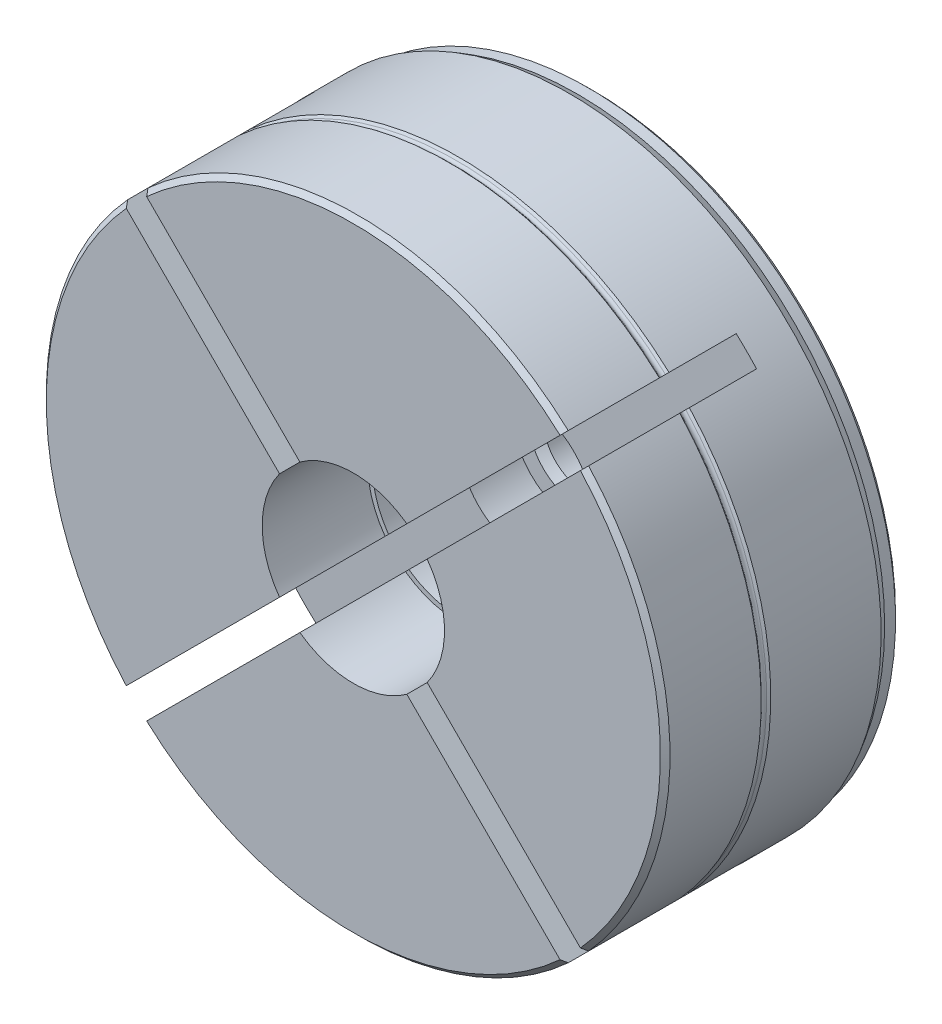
ISO-10303-21;
HEADER;
FILE_DESCRIPTION(('STEP AP214'),'2;1');
FILE_NAME('part.step','',(''),(''),'','','');
FILE_SCHEMA(('AUTOMOTIVE_DESIGN { 1 0 10303 214 1 1 1 1 }'));
ENDSEC;
DATA;
#1=APPLICATION_CONTEXT('core data for automotive mechanical design processes');
#2=APPLICATION_PROTOCOL_DEFINITION('international standard','automotive_design',2000,#1);
#3=PRODUCT_CONTEXT('',#1,'mechanical');
#4=PRODUCT('Part','Part','',(#3));
#5=PRODUCT_RELATED_PRODUCT_CATEGORY('part','',(#4));
#6=PRODUCT_DEFINITION_FORMATION('','',#4);
#7=PRODUCT_DEFINITION_CONTEXT('part definition',#1,'design');
#8=PRODUCT_DEFINITION('design','',#6,#7);
#9=PRODUCT_DEFINITION_SHAPE('','',#8);
#10=(LENGTH_UNIT() NAMED_UNIT(*) SI_UNIT(.MILLI.,.METRE.));
#11=(NAMED_UNIT(*) PLANE_ANGLE_UNIT() SI_UNIT($,.RADIAN.));
#12=(NAMED_UNIT(*) SI_UNIT($,.STERADIAN.) SOLID_ANGLE_UNIT());
#13=UNCERTAINTY_MEASURE_WITH_UNIT(LENGTH_MEASURE(1.E-05),#10,'distance_accuracy_value','');
#14=(GEOMETRIC_REPRESENTATION_CONTEXT(3) GLOBAL_UNCERTAINTY_ASSIGNED_CONTEXT((#13)) GLOBAL_UNIT_ASSIGNED_CONTEXT((#10,
#11,#12)) REPRESENTATION_CONTEXT('',''));
#15=CARTESIAN_POINT('',(0.,0.,0.));
#16=DIRECTION('',(0.,0.,1.));
#17=DIRECTION('',(1.,0.,0.));
#18=AXIS2_PLACEMENT_3D('',#15,#16,#17);
#19=CARTESIAN_POINT('',(0.,0.,26.7122837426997));
#20=DIRECTION('',(0.,0.,1.));
#21=DIRECTION('',(0.,1.,0.));
#22=AXIS2_PLACEMENT_3D('',#19,#20,#21);
#23=CYLINDRICAL_SURFACE('',#22,32.5);
#24=DIRECTION('',(0.,0.,1.));
#25=VECTOR('',#24,1.);
#26=CARTESIAN_POINT('',(-24.0171407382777,-21.8958203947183,26.7122837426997));
#27=LINE('',#26,#25);
#28=CARTESIAN_POINT('',(-24.0171407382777,-21.8958203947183,17.));
#29=VERTEX_POINT('',#28);
#30=CARTESIAN_POINT('',(-24.0171407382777,-21.8958203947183,10.));
#31=VERTEX_POINT('',#30);
#32=EDGE_CURVE('E978',#29,#31,#27,.F.);
#33=ORIENTED_EDGE('',*,*,#32,.F.);
#34=CARTESIAN_POINT('',(0.,0.,17.));
#35=DIRECTION('',(0.,0.,-1.));
#36=DIRECTION('',(0.,-1.,0.));
#37=AXIS2_PLACEMENT_3D('',#34,#35,#36);
#38=CIRCLE('',#37,32.5);
#39=CARTESIAN_POINT('',(-24.0171407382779,21.8958203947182,17.));
#40=VERTEX_POINT('',#39);
#41=EDGE_CURVE('E1118',#29,#40,#38,.T.);
#42=ORIENTED_EDGE('',*,*,#41,.T.);
#43=DIRECTION('',(0.,0.,1.));
#44=VECTOR('',#43,1.);
#45=CARTESIAN_POINT('',(-24.0171407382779,21.8958203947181,26.7122837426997));
#46=LINE('',#45,#44);
#47=CARTESIAN_POINT('',(-24.0171407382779,21.8958203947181,10.));
#48=VERTEX_POINT('',#47);
#49=EDGE_CURVE('E1012',#48,#40,#46,.T.);
#50=ORIENTED_EDGE('',*,*,#49,.F.);
#51=CARTESIAN_POINT('',(0.,0.,10.));
#52=DIRECTION('',(0.,0.,1.));
#53=DIRECTION('',(0.,1.,0.));
#54=AXIS2_PLACEMENT_3D('',#51,#52,#53);
#55=CIRCLE('',#54,32.5);
#56=CARTESIAN_POINT('',(-21.8958203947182,24.0171407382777,10.));
#57=VERTEX_POINT('',#56);
#58=EDGE_CURVE('E1015',#57,#48,#55,.T.);
#59=ORIENTED_EDGE('',*,*,#58,.F.);
#60=DIRECTION('',(0.,0.,1.));
#61=VECTOR('',#60,1.);
#62=CARTESIAN_POINT('',(-21.8958203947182,24.0171407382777,26.7122837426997));
#63=LINE('',#62,#61);
#64=CARTESIAN_POINT('',(-21.8958203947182,24.0171407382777,17.));
#65=VERTEX_POINT('',#64);
#66=EDGE_CURVE('E1005',#65,#57,#63,.F.);
#67=ORIENTED_EDGE('',*,*,#66,.F.);
#68=CARTESIAN_POINT('',(21.8958203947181,24.017140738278,17.));
#69=VERTEX_POINT('',#68);
#70=EDGE_CURVE('E1253',#65,#69,#38,.T.);
#71=ORIENTED_EDGE('',*,*,#70,.T.);
#72=DIRECTION('',(0.,0.,1.));
#73=VECTOR('',#72,1.);
#74=CARTESIAN_POINT('',(21.8958203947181,24.017140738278,26.7122837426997));
#75=LINE('',#74,#73);
#76=CARTESIAN_POINT('',(21.8958203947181,24.017140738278,10.));
#77=VERTEX_POINT('',#76);
#78=EDGE_CURVE('E983',#77,#69,#75,.T.);
#79=ORIENTED_EDGE('',*,*,#78,.F.);
#80=CARTESIAN_POINT('',(0.,0.,10.));
#81=DIRECTION('',(0.,0.,1.));
#82=DIRECTION('',(0.,1.,0.));
#83=AXIS2_PLACEMENT_3D('',#80,#81,#82);
#84=CIRCLE('',#83,32.5);
#85=CARTESIAN_POINT('',(24.0171407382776,21.8958203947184,10.));
#86=VERTEX_POINT('',#85);
#87=EDGE_CURVE('E992',#86,#77,#84,.T.);
#88=ORIENTED_EDGE('',*,*,#87,.F.);
#89=DIRECTION('',(0.,0.,1.));
#90=VECTOR('',#89,1.);
#91=CARTESIAN_POINT('',(24.0171407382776,21.8958203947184,26.7122837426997));
#92=LINE('',#91,#90);
#93=CARTESIAN_POINT('',(24.0171407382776,21.8958203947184,17.));
#94=VERTEX_POINT('',#93);
#95=EDGE_CURVE('E956',#94,#86,#92,.F.);
#96=ORIENTED_EDGE('',*,*,#95,.F.);
#97=CARTESIAN_POINT('',(24.017140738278,-21.8958203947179,17.));
#98=VERTEX_POINT('',#97);
#99=EDGE_CURVE('E1116',#94,#98,#38,.T.);
#100=ORIENTED_EDGE('',*,*,#99,.T.);
#101=DIRECTION('',(0.,0.,1.));
#102=VECTOR('',#101,1.);
#103=CARTESIAN_POINT('',(24.017140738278,-21.8958203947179,26.7122837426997));
#104=LINE('',#103,#102);
#105=CARTESIAN_POINT('',(24.017140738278,-21.8958203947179,10.));
#106=VERTEX_POINT('',#105);
#107=EDGE_CURVE('E963',#106,#98,#104,.T.);
#108=ORIENTED_EDGE('',*,*,#107,.F.);
#109=CARTESIAN_POINT('',(21.8958203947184,-24.0171407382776,10.));
#110=VERTEX_POINT('',#109);
#111=EDGE_CURVE('E994',#110,#106,#84,.T.);
#112=ORIENTED_EDGE('',*,*,#111,.F.);
#113=DIRECTION('',(0.,0.,1.));
#114=VECTOR('',#113,1.);
#115=CARTESIAN_POINT('',(21.8958203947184,-24.0171407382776,26.7122837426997));
#116=LINE('',#115,#114);
#117=CARTESIAN_POINT('',(21.8958203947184,-24.0171407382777,17.));
#118=VERTEX_POINT('',#117);
#119=EDGE_CURVE('E969',#118,#110,#116,.F.);
#120=ORIENTED_EDGE('',*,*,#119,.F.);
#121=CARTESIAN_POINT('',(-21.8958203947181,-24.017140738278,17.));
#122=VERTEX_POINT('',#121);
#123=EDGE_CURVE('E1111',#118,#122,#38,.T.);
#124=ORIENTED_EDGE('',*,*,#123,.T.);
#125=DIRECTION('',(0.,0.,1.));
#126=VECTOR('',#125,1.);
#127=CARTESIAN_POINT('',(-21.8958203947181,-24.017140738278,26.7122837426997));
#128=LINE('',#127,#126);
#129=CARTESIAN_POINT('',(-21.8958203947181,-24.017140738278,10.));
#130=VERTEX_POINT('',#129);
#131=EDGE_CURVE('E989',#130,#122,#128,.T.);
#132=ORIENTED_EDGE('',*,*,#131,.F.);
#133=EDGE_CURVE('E995',#31,#130,#84,.T.);
#134=ORIENTED_EDGE('',*,*,#133,.F.);
#135=EDGE_LOOP('',(#33,#42,#50,#59,#67,#71,#79,#88,#96,#100,#108,#112,#120,#124,#132,#134));
#136=FACE_BOUND('',#135,.T.);
#137=CARTESIAN_POINT('',(0.,0.,5.5));
#138=DIRECTION('',(0.,0.,-1.));
#139=DIRECTION('',(0.,-1.,0.));
#140=AXIS2_PLACEMENT_3D('',#137,#138,#139);
#141=CIRCLE('',#140,32.5);
#142=CARTESIAN_POINT('',(-32.4037034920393,2.5,5.5));
#143=VERTEX_POINT('',#142);
#144=CARTESIAN_POINT('',(-32.4037034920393,-2.5,5.5));
#145=VERTEX_POINT('',#144);
#146=EDGE_CURVE('E413',#143,#145,#141,.T.);
#147=ORIENTED_EDGE('',*,*,#146,.F.);
#148=DIRECTION('',(0.,0.,-1.));
#149=VECTOR('',#148,1.);
#150=CARTESIAN_POINT('',(-32.4037034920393,2.5,6.));
#151=LINE('',#150,#149);
#152=CARTESIAN_POINT('',(-32.4037034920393,2.5,6.));
#153=VERTEX_POINT('',#152);
#154=EDGE_CURVE('E1028',#153,#143,#151,.T.);
#155=ORIENTED_EDGE('',*,*,#154,.F.);
#156=CARTESIAN_POINT('',(0.,0.,6.));
#157=DIRECTION('',(0.,0.,-1.));
#158=DIRECTION('',(0.,-1.,0.));
#159=AXIS2_PLACEMENT_3D('',#156,#157,#158);
#160=CIRCLE('',#159,32.5);
#161=CARTESIAN_POINT('',(-32.4037034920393,-2.5,6.));
#162=VERTEX_POINT('',#161);
#163=EDGE_CURVE('E1017',#162,#153,#160,.T.);
#164=ORIENTED_EDGE('',*,*,#163,.F.);
#165=DIRECTION('',(0.,0.,-1.));
#166=VECTOR('',#165,1.);
#167=CARTESIAN_POINT('',(-32.4037034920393,-2.5,6.));
#168=LINE('',#167,#166);
#169=EDGE_CURVE('E1029',#162,#145,#168,.T.);
#170=ORIENTED_EDGE('',*,*,#169,.T.);
#171=EDGE_LOOP('',(#147,#155,#164,#170));
#172=FACE_BOUND('',#171,.T.);
#173=ADVANCED_FACE('F14',(#136,#172),#23,.T.);
#174=CARTESIAN_POINT('',(-28.5,0.,3.));
#175=DIRECTION('',(0.,0.,1.));
#176=DIRECTION('',(0.,1.,0.));
#177=AXIS2_PLACEMENT_3D('',#174,#175,#176);
#178=PLANE('',#177);
#179=DIRECTION('',(-1.,0.,0.));
#180=VECTOR('',#179,1.);
#181=CARTESIAN_POINT('',(-28.5,3.5,3.));
#182=LINE('',#181,#180);
#183=CARTESIAN_POINT('',(-28.7880183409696,3.5,3.));
#184=VERTEX_POINT('',#183);
#185=CARTESIAN_POINT('',(-31.3049516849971,3.5,3.));
#186=VERTEX_POINT('',#185);
#187=EDGE_CURVE('E564',#184,#186,#182,.T.);
#188=ORIENTED_EDGE('',*,*,#187,.T.);
#189=CARTESIAN_POINT('',(0.,0.,3.));
#190=DIRECTION('',(0.,0.,1.));
#191=DIRECTION('',(0.,1.,0.));
#192=AXIS2_PLACEMENT_3D('',#189,#190,#191);
#193=CIRCLE('',#192,31.5);
#194=CARTESIAN_POINT('',(-31.3049516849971,-3.5,3.));
#195=VERTEX_POINT('',#194);
#196=EDGE_CURVE('E460',#186,#195,#193,.F.);
#197=ORIENTED_EDGE('',*,*,#196,.T.);
#198=DIRECTION('',(1.,0.,0.));
#199=VECTOR('',#198,1.);
#200=CARTESIAN_POINT('',(-28.5,-3.5,3.));
#201=LINE('',#200,#199);
#202=CARTESIAN_POINT('',(-28.7880183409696,-3.5,3.));
#203=VERTEX_POINT('',#202);
#204=EDGE_CURVE('E561',#195,#203,#201,.T.);
#205=ORIENTED_EDGE('',*,*,#204,.T.);
#206=CARTESIAN_POINT('',(0.,0.,3.));
#207=DIRECTION('',(0.,0.,1.));
#208=DIRECTION('',(0.,1.,0.));
#209=AXIS2_PLACEMENT_3D('',#206,#207,#208);
#210=CIRCLE('',#209,29.);
#211=EDGE_CURVE('E1053',#203,#184,#210,.T.);
#212=ORIENTED_EDGE('',*,*,#211,.T.);
#213=EDGE_LOOP('',(#188,#197,#205,#212));
#214=FACE_BOUND('',#213,.T.);
#215=ADVANCED_FACE('F514',(#214),#178,.F.);
#216=CARTESIAN_POINT('',(-28.3901391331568,-2.5,6.));
#217=DIRECTION('',(0.,-1.,0.));
#218=DIRECTION('',(1.,0.,0.));
#219=AXIS2_PLACEMENT_3D('',#216,#217,#218);
#220=PLANE('',#219);
#221=DIRECTION('',(0.,0.,-1.));
#222=VECTOR('',#221,1.);
#223=CARTESIAN_POINT('',(-31.9021942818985,-2.5,0.));
#224=LINE('',#223,#222);
#225=CARTESIAN_POINT('',(-31.9021942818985,-2.5,4.63397459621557));
#226=VERTEX_POINT('',#225);
#227=CARTESIAN_POINT('',(-31.9021942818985,-2.5,4.));
#228=VERTEX_POINT('',#227);
#229=EDGE_CURVE('E422',#226,#228,#224,.T.);
#230=ORIENTED_EDGE('',*,*,#229,.F.);
#231=CARTESIAN_POINT('',(-35.9364147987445,-2.5,11.6024808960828));
#232=CARTESIAN_POINT('',(-35.2954719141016,-2.5,10.4950138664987));
#233=CARTESIAN_POINT('',(-34.6544688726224,-2.5,9.38758164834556));
#234=CARTESIAN_POINT('',(-33.3723164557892,-2.5,7.17280196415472));
#235=CARTESIAN_POINT('',(-32.7311670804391,-2.5,6.06545449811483));
#236=CARTESIAN_POINT('',(-31.4486959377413,-2.5,3.85085938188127));
#237=CARTESIAN_POINT('',(-30.8073741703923,-2.5,2.74361173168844));
#238=CARTESIAN_POINT('',(-29.5245207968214,-2.5,0.529237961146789));
#239=CARTESIAN_POINT('',(-28.8829891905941,-2.5,-0.577888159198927));
#240=CARTESIAN_POINT('',(-28.2413339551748,-2.5,-1.68494263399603));
#241=B_SPLINE_CURVE_WITH_KNOTS('',3,(#231,#232,#233,#234,#235,#236,#237,#238,#239,#240),
.UNSPECIFIED.,.F.,.F.,(4,2,2,2,4),(0.,3.83870017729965,7.6774002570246,11.5161003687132,
15.3548005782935),.UNSPECIFIED.);
#242=EDGE_CURVE('E407',#145,#226,#241,.T.);
#243=ORIENTED_EDGE('',*,*,#242,.F.);
#244=ORIENTED_EDGE('',*,*,#169,.F.);
#245=DIRECTION('',(-1.,0.,0.));
#246=VECTOR('',#245,1.);
#247=CARTESIAN_POINT('',(-28.3901391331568,-2.5,6.));
#248=LINE('',#247,#246);
#249=CARTESIAN_POINT('',(-28.3901391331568,-2.5,6.));
#250=VERTEX_POINT('',#249);
#251=EDGE_CURVE('E1025',#250,#162,#248,.T.);
#252=ORIENTED_EDGE('',*,*,#251,.F.);
#253=DIRECTION('',(0.,0.,-1.));
#254=VECTOR('',#253,1.);
#255=CARTESIAN_POINT('',(-28.3901391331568,-2.5,6.));
#256=LINE('',#255,#254);
#257=CARTESIAN_POINT('',(-28.3901391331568,-2.5,4.));
#258=VERTEX_POINT('',#257);
#259=EDGE_CURVE('E1032',#250,#258,#256,.T.);
#260=ORIENTED_EDGE('',*,*,#259,.T.);
#261=DIRECTION('',(-1.,0.,0.));
#262=VECTOR('',#261,1.);
#263=CARTESIAN_POINT('',(-28.3901391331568,-2.5,4.));
#264=LINE('',#263,#262);
#265=EDGE_CURVE('E429',#258,#228,#264,.T.);
#266=ORIENTED_EDGE('',*,*,#265,.T.);
#267=EDGE_LOOP('',(#230,#243,#244,#252,#260,#266));
#268=FACE_BOUND('',#267,.T.);
#269=ADVANCED_FACE('F426',(#268),#220,.F.);
#270=CARTESIAN_POINT('',(-28.3901391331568,2.5,6.));
#271=DIRECTION('',(0.,1.,0.));
#272=DIRECTION('',(-1.,0.,0.));
#273=AXIS2_PLACEMENT_3D('',#270,#271,#272);
#274=PLANE('',#273);
#275=DIRECTION('',(0.,0.,-1.));
#276=VECTOR('',#275,1.);
#277=CARTESIAN_POINT('',(-31.9021942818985,2.5,0.));
#278=LINE('',#277,#276);
#279=CARTESIAN_POINT('',(-31.9021942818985,2.5,4.));
#280=VERTEX_POINT('',#279);
#281=CARTESIAN_POINT('',(-31.9021942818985,2.5,4.63397459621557));
#282=VERTEX_POINT('',#281);
#283=EDGE_CURVE('E418',#280,#282,#278,.F.);
#284=ORIENTED_EDGE('',*,*,#283,.F.);
#285=DIRECTION('',(1.,0.,0.));
#286=VECTOR('',#285,1.);
#287=CARTESIAN_POINT('',(-28.3901391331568,2.5,4.));
#288=LINE('',#287,#286);
#289=CARTESIAN_POINT('',(-28.3901391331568,2.5,4.));
#290=VERTEX_POINT('',#289);
#291=EDGE_CURVE('E1058',#280,#290,#288,.T.);
#292=ORIENTED_EDGE('',*,*,#291,.T.);
#293=DIRECTION('',(0.,0.,-1.));
#294=VECTOR('',#293,1.);
#295=CARTESIAN_POINT('',(-28.3901391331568,2.5,6.));
#296=LINE('',#295,#294);
#297=CARTESIAN_POINT('',(-28.3901391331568,2.5,6.));
#298=VERTEX_POINT('',#297);
#299=EDGE_CURVE('E1034',#298,#290,#296,.T.);
#300=ORIENTED_EDGE('',*,*,#299,.F.);
#301=DIRECTION('',(1.,0.,0.));
#302=VECTOR('',#301,1.);
#303=CARTESIAN_POINT('',(-28.3901391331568,2.5,6.));
#304=LINE('',#303,#302);
#305=EDGE_CURVE('E1020',#153,#298,#304,.T.);
#306=ORIENTED_EDGE('',*,*,#305,.F.);
#307=ORIENTED_EDGE('',*,*,#154,.T.);
#308=CARTESIAN_POINT('',(-28.2413339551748,2.5,-1.68494263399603));
#309=CARTESIAN_POINT('',(-28.8829891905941,2.5,-0.577888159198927));
#310=CARTESIAN_POINT('',(-29.5245207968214,2.5,0.529237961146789));
#311=CARTESIAN_POINT('',(-30.8073741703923,2.5,2.74361173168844));
#312=CARTESIAN_POINT('',(-31.4486959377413,2.5,3.85085938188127));
#313=CARTESIAN_POINT('',(-32.7311670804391,2.5,6.06545449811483));
#314=CARTESIAN_POINT('',(-33.3723164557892,2.5,7.17280196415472));
#315=CARTESIAN_POINT('',(-34.6544688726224,2.5,9.38758164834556));
#316=CARTESIAN_POINT('',(-35.2954719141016,2.5,10.4950138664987));
#317=CARTESIAN_POINT('',(-35.9364147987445,2.5,11.6024808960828));
#318=B_SPLINE_CURVE_WITH_KNOTS('',3,(#308,#309,#310,#311,#312,#313,#314,#315,#316,#317),
.UNSPECIFIED.,.F.,.F.,(4,2,2,2,4),(0.,3.83870020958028,7.67740032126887,11.5161004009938,
15.3548005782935),.UNSPECIFIED.);
#319=EDGE_CURVE('E453',#282,#143,#318,.T.);
#320=ORIENTED_EDGE('',*,*,#319,.F.);
#321=EDGE_LOOP('',(#284,#292,#300,#306,#307,#320));
#322=FACE_BOUND('',#321,.T.);
#323=ADVANCED_FACE('F464',(#322),#274,.F.);
#324=CARTESIAN_POINT('',(-28.3901391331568,2.5,4.));
#325=DIRECTION('',(0.,0.707106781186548,0.707106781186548));
#326=DIRECTION('',(0.,0.707106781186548,-0.707106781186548));
#327=AXIS2_PLACEMENT_3D('',#324,#325,#326);
#328=PLANE('',#327);
#329=CARTESIAN_POINT('',(0.,0.,6.5));
#330=DIRECTION('',(0.,0.707106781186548,0.707106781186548));
#331=DIRECTION('',(0.,0.707106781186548,-0.707106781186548));
#332=AXIS2_PLACEMENT_3D('',#329,#330,#331);
#333=ELLIPSE('',#332,45.2548339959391,32.);
#334=CARTESIAN_POINT('',(-31.859064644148,3.,3.5));
#335=VERTEX_POINT('',#334);
#336=EDGE_CURVE('E430',#280,#335,#333,.F.);
#337=ORIENTED_EDGE('',*,*,#336,.T.);
#338=CARTESIAN_POINT('',(-31.859064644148,3.,3.5));
#339=CARTESIAN_POINT('',(-31.7672144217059,3.08361145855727,3.41638854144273));
#340=CARTESIAN_POINT('',(-31.6751132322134,3.16708385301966,3.33291614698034));
#341=CARTESIAN_POINT('',(-31.4904089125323,3.33375051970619,3.16624948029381));
#342=CARTESIAN_POINT('',(-31.3978057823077,3.41694479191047,3.08305520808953));
#343=CARTESIAN_POINT('',(-31.3049516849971,3.5,3.));
#344=B_SPLINE_CURVE_WITH_KNOTS('',3,(#338,#339,#340,#341,#342,#343),.UNSPECIFIED.,.F.,.F.,(4,2,
4),(0.,0.449178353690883,0.898356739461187),.UNSPECIFIED.);
#345=EDGE_CURVE('E9',#335,#186,#344,.T.);
#346=ORIENTED_EDGE('',*,*,#345,.T.);
#347=ORIENTED_EDGE('',*,*,#187,.F.);
#348=CARTESIAN_POINT('',(-28.3416654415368,3.,3.5));
#349=CARTESIAN_POINT('',(-28.4164732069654,3.08314782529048,3.41685217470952));
#350=CARTESIAN_POINT('',(-28.4910731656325,3.16638840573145,3.33361159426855));
#351=CARTESIAN_POINT('',(-28.6398574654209,3.33305507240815,3.16694492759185));
#352=CARTESIAN_POINT('',(-28.7140418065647,3.41648115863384,3.08351884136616));
#353=CARTESIAN_POINT('',(-28.7880183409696,3.5,3.));
#354=B_SPLINE_CURVE_WITH_KNOTS('',3,(#348,#349,#350,#351,#352,#353),.UNSPECIFIED.,.F.,.F.,(4,2,
4),(0.,0.418100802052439,0.836201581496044),.UNSPECIFIED.);
#355=CARTESIAN_POINT('',(-28.3416654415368,3.,3.5));
#356=VERTEX_POINT('',#355);
#357=EDGE_CURVE('E530',#356,#184,#354,.T.);
#358=ORIENTED_EDGE('',*,*,#357,.F.);
#359=CARTESIAN_POINT('',(0.,0.,6.5));
#360=DIRECTION('',(0.,0.707106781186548,0.707106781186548));
#361=DIRECTION('',(0.,-0.707106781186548,0.707106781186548));
#362=AXIS2_PLACEMENT_3D('',#359,#360,#361);
#363=ELLIPSE('',#362,40.3050865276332,28.5);
#364=EDGE_CURVE('E543',#290,#356,#363,.F.);
#365=ORIENTED_EDGE('',*,*,#364,.F.);
#366=ORIENTED_EDGE('',*,*,#291,.F.);
#367=EDGE_LOOP('',(#337,#346,#347,#358,#365,#366));
#368=FACE_BOUND('',#367,.T.);
#369=ADVANCED_FACE('F468',(#368),#328,.F.);
#370=CARTESIAN_POINT('',(-28.3901391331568,-2.5,4.));
#371=DIRECTION('',(0.,-0.707106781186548,0.707106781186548));
#372=DIRECTION('',(0.,0.707106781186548,0.707106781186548));
#373=AXIS2_PLACEMENT_3D('',#370,#371,#372);
#374=PLANE('',#373);
#375=ORIENTED_EDGE('',*,*,#204,.F.);
#376=CARTESIAN_POINT('',(-31.3049516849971,-3.5,3.));
#377=CARTESIAN_POINT('',(-31.3978057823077,-3.41694479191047,3.08305520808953));
#378=CARTESIAN_POINT('',(-31.4904089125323,-3.33375051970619,3.16624948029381));
#379=CARTESIAN_POINT('',(-31.6751132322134,-3.16708385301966,3.33291614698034));
#380=CARTESIAN_POINT('',(-31.7672144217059,-3.08361145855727,3.41638854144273));
#381=CARTESIAN_POINT('',(-31.859064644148,-3.,3.5));
#382=B_SPLINE_CURVE_WITH_KNOTS('',3,(#376,#377,#378,#379,#380,#381),.UNSPECIFIED.,.F.,.F.,(4,2,
4),(0.,0.449178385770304,0.898356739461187),.UNSPECIFIED.);
#383=CARTESIAN_POINT('',(-31.859064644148,-3.,3.5));
#384=VERTEX_POINT('',#383);
#385=EDGE_CURVE('E42',#195,#384,#382,.T.);
#386=ORIENTED_EDGE('',*,*,#385,.T.);
#387=CARTESIAN_POINT('',(0.,0.,6.5));
#388=DIRECTION('',(0.,-0.707106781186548,0.707106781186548));
#389=DIRECTION('',(0.,-0.707106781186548,-0.707106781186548));
#390=AXIS2_PLACEMENT_3D('',#387,#388,#389);
#391=ELLIPSE('',#390,45.2548339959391,32.);
#392=EDGE_CURVE('E461',#384,#228,#391,.F.);
#393=ORIENTED_EDGE('',*,*,#392,.T.);
#394=ORIENTED_EDGE('',*,*,#265,.F.);
#395=CARTESIAN_POINT('',(0.,0.,6.5));
#396=DIRECTION('',(0.,-0.707106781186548,0.707106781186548));
#397=DIRECTION('',(0.,0.707106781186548,0.707106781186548));
#398=AXIS2_PLACEMENT_3D('',#395,#396,#397);
#399=ELLIPSE('',#398,40.3050865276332,28.5);
#400=CARTESIAN_POINT('',(-28.3416654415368,-3.,3.5));
#401=VERTEX_POINT('',#400);
#402=EDGE_CURVE('E1059',#401,#258,#399,.F.);
#403=ORIENTED_EDGE('',*,*,#402,.F.);
#404=CARTESIAN_POINT('',(-28.7880183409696,-3.5,3.));
#405=CARTESIAN_POINT('',(-28.7140418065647,-3.41648115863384,3.08351884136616));
#406=CARTESIAN_POINT('',(-28.6398574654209,-3.33305507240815,3.16694492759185));
#407=CARTESIAN_POINT('',(-28.4910731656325,-3.16638840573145,3.33361159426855));
#408=CARTESIAN_POINT('',(-28.4164732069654,-3.08314782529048,3.41685217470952));
#409=CARTESIAN_POINT('',(-28.3416654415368,-3.,3.5));
#410=B_SPLINE_CURVE_WITH_KNOTS('',3,(#404,#405,#406,#407,#408,#409),.UNSPECIFIED.,.F.,.F.,(4,2,
4),(0.,0.418100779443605,0.836201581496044),.UNSPECIFIED.);
#411=EDGE_CURVE('E537',#203,#401,#410,.T.);
#412=ORIENTED_EDGE('',*,*,#411,.F.);
#413=EDGE_LOOP('',(#375,#386,#393,#394,#403,#412));
#414=FACE_BOUND('',#413,.T.);
#415=ADVANCED_FACE('F545',(#414),#374,.F.);
#416=CARTESIAN_POINT('',(-24.0171407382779,21.8958203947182,18.));
#417=VERTEX_POINT('',#416);
#418=CARTESIAN_POINT('',(-24.0171407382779,21.8958203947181,27.5));
#419=VERTEX_POINT('',#418);
#420=EDGE_CURVE('E1011',#417,#419,#46,.T.);
#421=ORIENTED_EDGE('',*,*,#420,.F.);
#422=CARTESIAN_POINT('',(0.,0.,18.));
#423=DIRECTION('',(0.,0.,-1.));
#424=DIRECTION('',(0.,-1.,0.));
#425=AXIS2_PLACEMENT_3D('',#422,#423,#424);
#426=CIRCLE('',#425,32.5);
#427=CARTESIAN_POINT('',(-24.0171407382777,-21.8958203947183,18.));
#428=VERTEX_POINT('',#427);
#429=EDGE_CURVE('E1093',#428,#417,#426,.T.);
#430=ORIENTED_EDGE('',*,*,#429,.F.);
#431=CARTESIAN_POINT('',(-24.0171407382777,-21.8958203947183,27.5));
#432=VERTEX_POINT('',#431);
#433=EDGE_CURVE('E979',#432,#428,#27,.F.);
#434=ORIENTED_EDGE('',*,*,#433,.F.);
#435=CARTESIAN_POINT('',(0.,0.,27.5));
#436=DIRECTION('',(0.,0.,-1.));
#437=DIRECTION('',(0.,-1.,0.));
#438=AXIS2_PLACEMENT_3D('',#435,#436,#437);
#439=CIRCLE('',#438,32.5);
#440=EDGE_CURVE('E648',#432,#419,#439,.T.);
#441=ORIENTED_EDGE('',*,*,#440,.T.);
#442=EDGE_LOOP('',(#421,#430,#434,#441));
#443=FACE_BOUND('',#442,.T.);
#444=ADVANCED_FACE('F549',(#443),#23,.T.);
#445=CARTESIAN_POINT('',(-21.8958203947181,-24.017140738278,18.));
#446=VERTEX_POINT('',#445);
#447=CARTESIAN_POINT('',(-21.8958203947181,-24.017140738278,27.5));
#448=VERTEX_POINT('',#447);
#449=EDGE_CURVE('E988',#446,#448,#128,.T.);
#450=ORIENTED_EDGE('',*,*,#449,.F.);
#451=CARTESIAN_POINT('',(21.8958203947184,-24.0171407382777,18.));
#452=VERTEX_POINT('',#451);
#453=EDGE_CURVE('E417',#452,#446,#426,.T.);
#454=ORIENTED_EDGE('',*,*,#453,.F.);
#455=CARTESIAN_POINT('',(21.8958203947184,-24.0171407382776,27.5));
#456=VERTEX_POINT('',#455);
#457=EDGE_CURVE('E970',#456,#452,#116,.F.);
#458=ORIENTED_EDGE('',*,*,#457,.F.);
#459=CARTESIAN_POINT('',(0.,0.,27.5));
#460=DIRECTION('',(0.,0.,-1.));
#461=DIRECTION('',(0.,-1.,0.));
#462=AXIS2_PLACEMENT_3D('',#459,#460,#461);
#463=CIRCLE('',#462,32.5);
#464=EDGE_CURVE('E1147',#456,#448,#463,.T.);
#465=ORIENTED_EDGE('',*,*,#464,.T.);
#466=EDGE_LOOP('',(#450,#454,#458,#465));
#467=FACE_BOUND('',#466,.T.);
#468=ADVANCED_FACE('F1082',(#467),#23,.T.);
#469=CARTESIAN_POINT('',(24.017140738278,-21.8958203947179,18.));
#470=VERTEX_POINT('',#469);
#471=CARTESIAN_POINT('',(24.017140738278,-21.8958203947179,27.5));
#472=VERTEX_POINT('',#471);
#473=EDGE_CURVE('E962',#470,#472,#104,.T.);
#474=ORIENTED_EDGE('',*,*,#473,.F.);
#475=CARTESIAN_POINT('',(24.0171407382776,21.8958203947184,18.));
#476=VERTEX_POINT('',#475);
#477=EDGE_CURVE('E1126',#476,#470,#426,.T.);
#478=ORIENTED_EDGE('',*,*,#477,.F.);
#479=CARTESIAN_POINT('',(24.0171407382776,21.8958203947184,27.5));
#480=VERTEX_POINT('',#479);
#481=EDGE_CURVE('E957',#480,#476,#92,.F.);
#482=ORIENTED_EDGE('',*,*,#481,.F.);
#483=CARTESIAN_POINT('',(0.,0.,27.5));
#484=DIRECTION('',(0.,0.,-1.));
#485=DIRECTION('',(0.,-1.,0.));
#486=AXIS2_PLACEMENT_3D('',#483,#484,#485);
#487=CIRCLE('',#486,32.5);
#488=EDGE_CURVE('E1144',#480,#472,#487,.T.);
#489=ORIENTED_EDGE('',*,*,#488,.T.);
#490=EDGE_LOOP('',(#474,#478,#482,#489));
#491=FACE_BOUND('',#490,.T.);
#492=ADVANCED_FACE('F520',(#491),#23,.T.);
#493=CARTESIAN_POINT('',(21.8958203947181,24.017140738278,18.));
#494=VERTEX_POINT('',#493);
#495=CARTESIAN_POINT('',(21.8958203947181,24.017140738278,27.5));
#496=VERTEX_POINT('',#495);
#497=EDGE_CURVE('E982',#494,#496,#75,.T.);
#498=ORIENTED_EDGE('',*,*,#497,.F.);
#499=CARTESIAN_POINT('',(-21.8958203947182,24.0171407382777,18.));
#500=VERTEX_POINT('',#499);
#501=EDGE_CURVE('E1125',#500,#494,#426,.T.);
#502=ORIENTED_EDGE('',*,*,#501,.F.);
#503=CARTESIAN_POINT('',(-21.8958203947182,24.0171407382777,27.5));
#504=VERTEX_POINT('',#503);
#505=EDGE_CURVE('E1006',#504,#500,#63,.F.);
#506=ORIENTED_EDGE('',*,*,#505,.F.);
#507=CARTESIAN_POINT('',(0.,0.,27.5));
#508=DIRECTION('',(0.,0.,-1.));
#509=DIRECTION('',(0.,-1.,0.));
#510=AXIS2_PLACEMENT_3D('',#507,#508,#509);
#511=CIRCLE('',#510,32.5);
#512=EDGE_CURVE('E622',#504,#496,#511,.T.);
#513=ORIENTED_EDGE('',*,*,#512,.T.);
#514=EDGE_LOOP('',(#498,#502,#506,#513));
#515=FACE_BOUND('',#514,.T.);
#516=ADVANCED_FACE('F479',(#515),#23,.T.);
#517=CARTESIAN_POINT('',(0.,0.,26.7122837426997));
#518=DIRECTION('',(0.,0.,1.));
#519=DIRECTION('',(0.,1.,0.));
#520=AXIS2_PLACEMENT_3D('',#517,#518,#519);
#521=CYLINDRICAL_SURFACE('',#520,7.);
#522=CARTESIAN_POINT('',(0.,0.,4.5));
#523=DIRECTION('',(0.,0.,1.));
#524=DIRECTION('',(0.,1.,0.));
#525=AXIS2_PLACEMENT_3D('',#522,#523,#524);
#526=CIRCLE('',#525,7.);
#527=CARTESIAN_POINT('',(0.,7.,4.5));
#528=VERTEX_POINT('',#527);
#529=EDGE_CURVE('E1031',#528,#528,#526,.T.);
#530=ORIENTED_EDGE('',*,*,#529,.F.);
#531=EDGE_LOOP('',(#530));
#532=FACE_BOUND('',#531,.T.);
#533=DIRECTION('',(0.,0.,1.));
#534=VECTOR('',#533,1.);
#535=CARTESIAN_POINT('',(5.89543007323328,-3.77410972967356,26.7122837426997));
#536=LINE('',#535,#534);
#537=CARTESIAN_POINT('',(5.89543007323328,-3.77410972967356,13.));
#538=VERTEX_POINT('',#537);
#539=CARTESIAN_POINT('',(5.89543007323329,-3.77410972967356,10.));
#540=VERTEX_POINT('',#539);
#541=EDGE_CURVE('E960',#538,#540,#536,.F.);
#542=ORIENTED_EDGE('',*,*,#541,.F.);
#543=CARTESIAN_POINT('',(0.,0.,13.));
#544=DIRECTION('',(0.,0.,-1.));
#545=DIRECTION('',(0.,-1.,0.));
#546=AXIS2_PLACEMENT_3D('',#543,#544,#545);
#547=CIRCLE('',#546,7.);
#548=CARTESIAN_POINT('',(5.89543007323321,3.77410972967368,13.));
#549=VERTEX_POINT('',#548);
#550=EDGE_CURVE('E884',#538,#549,#547,.F.);
#551=ORIENTED_EDGE('',*,*,#550,.T.);
#552=DIRECTION('',(0.,0.,1.));
#553=VECTOR('',#552,1.);
#554=CARTESIAN_POINT('',(5.89543007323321,3.77410972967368,26.7122837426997));
#555=LINE('',#554,#553);
#556=CARTESIAN_POINT('',(5.8954300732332,3.77410972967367,10.));
#557=VERTEX_POINT('',#556);
#558=EDGE_CURVE('E953',#557,#549,#555,.T.);
#559=ORIENTED_EDGE('',*,*,#558,.F.);
#560=CARTESIAN_POINT('',(0.,0.,10.));
#561=DIRECTION('',(0.,0.,1.));
#562=DIRECTION('',(0.,1.,0.));
#563=AXIS2_PLACEMENT_3D('',#560,#561,#562);
#564=CIRCLE('',#563,7.);
#565=CARTESIAN_POINT('',(3.77410972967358,5.89543007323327,10.));
#566=VERTEX_POINT('',#565);
#567=EDGE_CURVE('E593',#566,#557,#564,.F.);
#568=ORIENTED_EDGE('',*,*,#567,.F.);
#569=DIRECTION('',(0.,0.,1.));
#570=VECTOR('',#569,1.);
#571=CARTESIAN_POINT('',(3.77410972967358,5.89543007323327,26.7122837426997));
#572=LINE('',#571,#570);
#573=CARTESIAN_POINT('',(3.77410972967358,5.89543007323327,13.));
#574=VERTEX_POINT('',#573);
#575=EDGE_CURVE('E976',#574,#566,#572,.F.);
#576=ORIENTED_EDGE('',*,*,#575,.F.);
#577=CARTESIAN_POINT('',(-3.77410972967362,5.89543007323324,13.));
#578=VERTEX_POINT('',#577);
#579=EDGE_CURVE('E875',#574,#578,#547,.F.);
#580=ORIENTED_EDGE('',*,*,#579,.T.);
#581=DIRECTION('',(0.,0.,1.));
#582=VECTOR('',#581,1.);
#583=CARTESIAN_POINT('',(-3.77410972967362,5.89543007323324,26.7122837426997));
#584=LINE('',#583,#582);
#585=CARTESIAN_POINT('',(-3.77410972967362,5.89543007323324,10.));
#586=VERTEX_POINT('',#585);
#587=EDGE_CURVE('E1002',#586,#578,#584,.T.);
#588=ORIENTED_EDGE('',*,*,#587,.F.);
#589=CARTESIAN_POINT('',(0.,0.,10.));
#590=DIRECTION('',(0.,0.,1.));
#591=DIRECTION('',(0.,1.,0.));
#592=AXIS2_PLACEMENT_3D('',#589,#590,#591);
#593=CIRCLE('',#592,7.);
#594=CARTESIAN_POINT('',(-5.89543007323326,3.7741097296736,10.));
#595=VERTEX_POINT('',#594);
#596=EDGE_CURVE('E577',#595,#586,#593,.F.);
#597=ORIENTED_EDGE('',*,*,#596,.F.);
#598=DIRECTION('',(0.,0.,1.));
#599=VECTOR('',#598,1.);
#600=CARTESIAN_POINT('',(-5.89543007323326,3.7741097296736,26.7122837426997));
#601=LINE('',#600,#599);
#602=CARTESIAN_POINT('',(-5.89543007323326,3.7741097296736,13.));
#603=VERTEX_POINT('',#602);
#604=EDGE_CURVE('E1009',#603,#595,#601,.F.);
#605=ORIENTED_EDGE('',*,*,#604,.F.);
#606=CARTESIAN_POINT('',(-5.89543007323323,-3.77410972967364,13.));
#607=VERTEX_POINT('',#606);
#608=EDGE_CURVE('E871',#603,#607,#547,.F.);
#609=ORIENTED_EDGE('',*,*,#608,.T.);
#610=DIRECTION('',(0.,0.,1.));
#611=VECTOR('',#610,1.);
#612=CARTESIAN_POINT('',(-5.89543007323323,-3.77410972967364,26.7122837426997));
#613=LINE('',#612,#611);
#614=CARTESIAN_POINT('',(-5.89543007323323,-3.77410972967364,10.));
#615=VERTEX_POINT('',#614);
#616=EDGE_CURVE('E973',#615,#607,#613,.T.);
#617=ORIENTED_EDGE('',*,*,#616,.F.);
#618=CARTESIAN_POINT('',(-3.77410972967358,-5.89543007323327,10.));
#619=VERTEX_POINT('',#618);
#620=EDGE_CURVE('E596',#619,#615,#564,.F.);
#621=ORIENTED_EDGE('',*,*,#620,.F.);
#622=DIRECTION('',(0.,0.,1.));
#623=VECTOR('',#622,1.);
#624=CARTESIAN_POINT('',(-3.77410972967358,-5.89543007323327,26.7122837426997));
#625=LINE('',#624,#623);
#626=CARTESIAN_POINT('',(-3.77410972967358,-5.89543007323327,13.));
#627=VERTEX_POINT('',#626);
#628=EDGE_CURVE('E986',#627,#619,#625,.F.);
#629=ORIENTED_EDGE('',*,*,#628,.F.);
#630=CARTESIAN_POINT('',(3.77410972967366,-5.89543007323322,13.));
#631=VERTEX_POINT('',#630);
#632=EDGE_CURVE('E876',#627,#631,#547,.F.);
#633=ORIENTED_EDGE('',*,*,#632,.T.);
#634=DIRECTION('',(0.,0.,1.));
#635=VECTOR('',#634,1.);
#636=CARTESIAN_POINT('',(3.77410972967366,-5.89543007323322,26.7122837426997));
#637=LINE('',#636,#635);
#638=CARTESIAN_POINT('',(3.77410972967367,-5.89543007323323,10.));
#639=VERTEX_POINT('',#638);
#640=EDGE_CURVE('E966',#639,#631,#637,.T.);
#641=ORIENTED_EDGE('',*,*,#640,.F.);
#642=EDGE_CURVE('E595',#540,#639,#564,.F.);
#643=ORIENTED_EDGE('',*,*,#642,.F.);
#644=EDGE_LOOP('',(#542,#551,#559,#568,#576,#580,#588,#597,#605,#609,#617,#621,#629,#633,#641,#643));
#645=FACE_BOUND('',#644,.T.);
#646=ADVANCED_FACE('F474',(#532,#645),#521,.F.);
#647=CARTESIAN_POINT('',(-7.,0.,28.));
#648=DIRECTION('',(0.,0.,-1.));
#649=DIRECTION('',(0.,-1.,0.));
#650=AXIS2_PLACEMENT_3D('',#647,#648,#649);
#651=PLANE('',#650);
#652=DIRECTION('',(0.707106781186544,0.707106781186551,0.));
#653=VECTOR('',#652,1.);
#654=CARTESIAN_POINT('',(-2.43933982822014,-4.56066017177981,28.));
#655=LINE('',#654,#653);
#656=CARTESIAN_POINT('',(-21.5418839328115,-23.6632042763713,28.));
#657=VERTEX_POINT('',#656);
#658=CARTESIAN_POINT('',(-5.57258940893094,-7.69390975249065,28.));
#659=VERTEX_POINT('',#658);
#660=EDGE_CURVE('E591',#657,#659,#655,.T.);
#661=ORIENTED_EDGE('',*,*,#660,.F.);
#662=CARTESIAN_POINT('',(0.,0.,28.));
#663=DIRECTION('',(0.,0.,-1.));
#664=DIRECTION('',(0.,-1.,0.));
#665=AXIS2_PLACEMENT_3D('',#662,#663,#664);
#666=CIRCLE('',#665,32.);
#667=CARTESIAN_POINT('',(21.5418839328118,-23.663204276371,28.));
#668=VERTEX_POINT('',#667);
#669=EDGE_CURVE('E647',#657,#668,#666,.F.);
#670=ORIENTED_EDGE('',*,*,#669,.T.);
#671=DIRECTION('',(0.707106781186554,-0.707106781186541,0.));
#672=VECTOR('',#671,1.);
#673=CARTESIAN_POINT('',(-4.56066017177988,2.43933982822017,28.));
#674=LINE('',#673,#672);
#675=CARTESIAN_POINT('',(5.57258940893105,-7.69390975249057,28.));
#676=VERTEX_POINT('',#675);
#677=EDGE_CURVE('E584',#676,#668,#674,.T.);
#678=ORIENTED_EDGE('',*,*,#677,.F.);
#679=CARTESIAN_POINT('',(0.,0.,28.));
#680=DIRECTION('',(0.,0.,-1.));
#681=DIRECTION('',(0.,-1.,0.));
#682=AXIS2_PLACEMENT_3D('',#679,#680,#681);
#683=CIRCLE('',#682,9.5);
#684=EDGE_CURVE('E866',#676,#659,#683,.T.);
#685=ORIENTED_EDGE('',*,*,#684,.T.);
#686=EDGE_LOOP('',(#661,#670,#678,#685));
#687=FACE_BOUND('',#686,.T.);
#688=ADVANCED_FACE('F470',(#687),#651,.F.);
#689=DIRECTION('',(-0.707106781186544,-0.707106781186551,0.));
#690=VECTOR('',#689,1.);
#691=CARTESIAN_POINT('',(-4.56066017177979,-2.43933982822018,28.));
#692=LINE('',#691,#690);
#693=CARTESIAN_POINT('',(21.5418839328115,23.6632042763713,28.));
#694=VERTEX_POINT('',#693);
#695=CARTESIAN_POINT('',(5.57258940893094,7.69390975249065,28.));
#696=VERTEX_POINT('',#695);
#697=EDGE_CURVE('E590',#694,#696,#692,.T.);
#698=ORIENTED_EDGE('',*,*,#697,.F.);
#699=CARTESIAN_POINT('',(0.,0.,28.));
#700=DIRECTION('',(0.,0.,-1.));
#701=DIRECTION('',(0.,-1.,0.));
#702=AXIS2_PLACEMENT_3D('',#699,#700,#701);
#703=CIRCLE('',#702,32.);
#704=CARTESIAN_POINT('',(-21.5418839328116,23.6632042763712,28.));
#705=VERTEX_POINT('',#704);
#706=EDGE_CURVE('E1154',#694,#705,#703,.F.);
#707=ORIENTED_EDGE('',*,*,#706,.T.);
#708=DIRECTION('',(-0.707106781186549,0.707106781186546,0.));
#709=VECTOR('',#708,1.);
#710=CARTESIAN_POINT('',(-2.4393398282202,4.56066017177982,28.));
#711=LINE('',#710,#709);
#712=CARTESIAN_POINT('',(-5.57258940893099,7.69390975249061,28.));
#713=VERTEX_POINT('',#712);
#714=EDGE_CURVE('E572',#713,#705,#711,.T.);
#715=ORIENTED_EDGE('',*,*,#714,.F.);
#716=EDGE_CURVE('E1336',#713,#696,#683,.T.);
#717=ORIENTED_EDGE('',*,*,#716,.T.);
#718=EDGE_LOOP('',(#698,#707,#715,#717));
#719=FACE_BOUND('',#718,.T.);
#720=ADVANCED_FACE('F473',(#719),#651,.F.);
#721=DIRECTION('',(0.707106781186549,-0.707106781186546,0.));
#722=VECTOR('',#721,1.);
#723=CARTESIAN_POINT('',(-4.56066017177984,2.43933982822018,28.));
#724=LINE('',#723,#722);
#725=CARTESIAN_POINT('',(-23.6632042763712,21.5418839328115,28.));
#726=VERTEX_POINT('',#725);
#727=CARTESIAN_POINT('',(-7.69390975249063,5.57258940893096,28.));
#728=VERTEX_POINT('',#727);
#729=EDGE_CURVE('E575',#726,#728,#724,.T.);
#730=ORIENTED_EDGE('',*,*,#729,.F.);
#731=CARTESIAN_POINT('',(0.,0.,28.));
#732=DIRECTION('',(0.,0.,-1.));
#733=DIRECTION('',(0.,-1.,0.));
#734=AXIS2_PLACEMENT_3D('',#731,#732,#733);
#735=CIRCLE('',#734,32.);
#736=CARTESIAN_POINT('',(-23.6632042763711,-21.5418839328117,28.));
#737=VERTEX_POINT('',#736);
#738=EDGE_CURVE('E612',#726,#737,#735,.F.);
#739=ORIENTED_EDGE('',*,*,#738,.T.);
#740=CARTESIAN_POINT('',(-7.69390975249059,-5.57258940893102,28.));
#741=VERTEX_POINT('',#740);
#742=EDGE_CURVE('E587',#741,#737,#692,.T.);
#743=ORIENTED_EDGE('',*,*,#742,.F.);
#744=EDGE_CURVE('E870',#741,#728,#683,.T.);
#745=ORIENTED_EDGE('',*,*,#744,.T.);
#746=EDGE_LOOP('',(#730,#739,#743,#745));
#747=FACE_BOUND('',#746,.T.);
#748=ADVANCED_FACE('F1319',(#747),#651,.F.);
#749=DIRECTION('',(-0.707106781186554,0.707106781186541,0.));
#750=VECTOR('',#749,1.);
#751=CARTESIAN_POINT('',(-2.43933982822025,4.56066017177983,28.));
#752=LINE('',#751,#750);
#753=CARTESIAN_POINT('',(23.6632042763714,-21.5418839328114,28.));
#754=VERTEX_POINT('',#753);
#755=CARTESIAN_POINT('',(7.69390975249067,-5.57258940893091,28.));
#756=VERTEX_POINT('',#755);
#757=EDGE_CURVE('E582',#754,#756,#752,.T.);
#758=ORIENTED_EDGE('',*,*,#757,.F.);
#759=CARTESIAN_POINT('',(0.,0.,28.));
#760=DIRECTION('',(0.,0.,-1.));
#761=DIRECTION('',(0.,-1.,0.));
#762=AXIS2_PLACEMENT_3D('',#759,#760,#761);
#763=CIRCLE('',#762,32.);
#764=CARTESIAN_POINT('',(23.663204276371,21.5418839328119,28.));
#765=VERTEX_POINT('',#764);
#766=EDGE_CURVE('E1152',#754,#765,#763,.F.);
#767=ORIENTED_EDGE('',*,*,#766,.T.);
#768=DIRECTION('',(0.707106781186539,0.707106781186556,0.));
#769=VECTOR('',#768,1.);
#770=CARTESIAN_POINT('',(-2.43933982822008,-4.56066017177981,28.));
#771=LINE('',#770,#769);
#772=CARTESIAN_POINT('',(7.69390975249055,5.57258940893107,28.));
#773=VERTEX_POINT('',#772);
#774=EDGE_CURVE('E579',#773,#765,#771,.T.);
#775=ORIENTED_EDGE('',*,*,#774,.F.);
#776=EDGE_CURVE('E869',#773,#756,#683,.T.);
#777=ORIENTED_EDGE('',*,*,#776,.T.);
#778=EDGE_LOOP('',(#758,#767,#775,#777));
#779=FACE_BOUND('',#778,.T.);
#780=ADVANCED_FACE('F476',(#779),#651,.F.);
#781=CARTESIAN_POINT('',(0.,0.,26.7122837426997));
#782=DIRECTION('',(0.,0.,1.));
#783=DIRECTION('',(0.,1.,0.));
#784=AXIS2_PLACEMENT_3D('',#781,#782,#783);
#785=CYLINDRICAL_SURFACE('',#784,28.5);
#786=ORIENTED_EDGE('',*,*,#299,.T.);
#787=ORIENTED_EDGE('',*,*,#364,.T.);
#788=CARTESIAN_POINT('',(0.,0.,3.5));
#789=DIRECTION('',(0.,0.,1.));
#790=DIRECTION('',(0.,1.,0.));
#791=AXIS2_PLACEMENT_3D('',#788,#789,#790);
#792=CIRCLE('',#791,28.5);
#793=EDGE_CURVE('E1055',#356,#401,#792,.F.);
#794=ORIENTED_EDGE('',*,*,#793,.T.);
#795=ORIENTED_EDGE('',*,*,#402,.T.);
#796=ORIENTED_EDGE('',*,*,#259,.F.);
#797=CARTESIAN_POINT('',(0.,0.,6.));
#798=DIRECTION('',(0.,0.,1.));
#799=DIRECTION('',(0.,-1.,0.));
#800=AXIS2_PLACEMENT_3D('',#797,#798,#799);
#801=CIRCLE('',#800,28.5);
#802=EDGE_CURVE('E1023',#298,#250,#801,.T.);
#803=ORIENTED_EDGE('',*,*,#802,.F.);
#804=EDGE_LOOP('',(#786,#787,#794,#795,#796,#803));
#805=FACE_BOUND('',#804,.T.);
#806=CARTESIAN_POINT('',(0.,0.,7.5));
#807=DIRECTION('',(0.,0.,1.));
#808=DIRECTION('',(0.,1.,0.));
#809=AXIS2_PLACEMENT_3D('',#806,#807,#808);
#810=CIRCLE('',#809,28.5);
#811=CARTESIAN_POINT('',(0.,28.5,7.5));
#812=VERTEX_POINT('',#811);
#813=EDGE_CURVE('E1050',#812,#812,#810,.T.);
#814=ORIENTED_EDGE('',*,*,#813,.T.);
#815=EDGE_LOOP('',(#814));
#816=FACE_BOUND('',#815,.T.);
#817=ADVANCED_FACE('F509',(#805,#816),#785,.F.);
#818=CARTESIAN_POINT('',(0.,0.,7.5));
#819=DIRECTION('',(0.,0.,1.));
#820=DIRECTION('',(0.,1.,0.));
#821=AXIS2_PLACEMENT_3D('',#818,#819,#820);
#822=TOROIDAL_SURFACE('',#821,27.,1.5);
#823=ORIENTED_EDGE('',*,*,#813,.F.);
#824=EDGE_LOOP('',(#823));
#825=FACE_BOUND('',#824,.T.);
#826=CARTESIAN_POINT('',(0.,0.,9.));
#827=DIRECTION('',(0.,0.,1.));
#828=DIRECTION('',(0.,1.,0.));
#829=AXIS2_PLACEMENT_3D('',#826,#827,#828);
#830=CIRCLE('',#829,27.);
#831=CARTESIAN_POINT('',(0.,27.,9.));
#832=VERTEX_POINT('',#831);
#833=EDGE_CURVE('E1047',#832,#832,#830,.T.);
#834=ORIENTED_EDGE('',*,*,#833,.T.);
#835=EDGE_LOOP('',(#834));
#836=FACE_BOUND('',#835,.T.);
#837=ADVANCED_FACE('F505',(#825,#836),#822,.F.);
#838=CARTESIAN_POINT('',(-11.5,0.,9.));
#839=DIRECTION('',(0.,0.,1.));
#840=DIRECTION('',(0.,1.,0.));
#841=AXIS2_PLACEMENT_3D('',#838,#839,#840);
#842=PLANE('',#841);
#843=ORIENTED_EDGE('',*,*,#833,.F.);
#844=EDGE_LOOP('',(#843));
#845=FACE_BOUND('',#844,.T.);
#846=CARTESIAN_POINT('',(0.,0.,9.));
#847=DIRECTION('',(0.,0.,1.));
#848=DIRECTION('',(0.,1.,0.));
#849=AXIS2_PLACEMENT_3D('',#846,#847,#848);
#850=CIRCLE('',#849,11.5);
#851=CARTESIAN_POINT('',(0.,11.5,9.));
#852=VERTEX_POINT('',#851);
#853=EDGE_CURVE('E1044',#852,#852,#850,.T.);
#854=ORIENTED_EDGE('',*,*,#853,.T.);
#855=EDGE_LOOP('',(#854));
#856=FACE_BOUND('',#855,.T.);
#857=ADVANCED_FACE('F501',(#845,#856),#842,.F.);
#858=CARTESIAN_POINT('',(0.,0.,7.5));
#859=DIRECTION('',(0.,0.,1.));
#860=DIRECTION('',(0.,1.,0.));
#861=AXIS2_PLACEMENT_3D('',#858,#859,#860);
#862=TOROIDAL_SURFACE('',#861,11.5,1.5);
#863=ORIENTED_EDGE('',*,*,#853,.F.);
#864=EDGE_LOOP('',(#863));
#865=FACE_BOUND('',#864,.T.);
#866=CARTESIAN_POINT('',(0.,0.,7.5));
#867=DIRECTION('',(0.,0.,1.));
#868=DIRECTION('',(0.,1.,0.));
#869=AXIS2_PLACEMENT_3D('',#866,#867,#868);
#870=CIRCLE('',#869,10.);
#871=CARTESIAN_POINT('',(0.,10.,7.5));
#872=VERTEX_POINT('',#871);
#873=EDGE_CURVE('E1041',#872,#872,#870,.T.);
#874=ORIENTED_EDGE('',*,*,#873,.T.);
#875=EDGE_LOOP('',(#874));
#876=FACE_BOUND('',#875,.T.);
#877=ADVANCED_FACE('F497',(#865,#876),#862,.F.);
#878=CARTESIAN_POINT('',(0.,0.,26.7122837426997));
#879=DIRECTION('',(0.,0.,1.));
#880=DIRECTION('',(0.,1.,0.));
#881=AXIS2_PLACEMENT_3D('',#878,#879,#880);
#882=CYLINDRICAL_SURFACE('',#881,10.);
#883=CARTESIAN_POINT('',(0.,0.,0.999999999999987));
#884=DIRECTION('',(0.,0.,1.));
#885=DIRECTION('',(0.,1.,0.));
#886=AXIS2_PLACEMENT_3D('',#883,#884,#885);
#887=CIRCLE('',#886,10.);
#888=CARTESIAN_POINT('',(0.,10.,0.999999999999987));
#889=VERTEX_POINT('',#888);
#890=EDGE_CURVE('E597',#889,#889,#887,.T.);
#891=ORIENTED_EDGE('',*,*,#890,.T.);
#892=EDGE_LOOP('',(#891));
#893=FACE_BOUND('',#892,.T.);
#894=ORIENTED_EDGE('',*,*,#873,.F.);
#895=EDGE_LOOP('',(#894));
#896=FACE_BOUND('',#895,.T.);
#897=ADVANCED_FACE('F493',(#893,#896),#882,.T.);
#898=CARTESIAN_POINT('',(-10.,0.,0.));
#899=DIRECTION('',(0.,0.,1.));
#900=DIRECTION('',(0.,1.,0.));
#901=AXIS2_PLACEMENT_3D('',#898,#899,#900);
#902=PLANE('',#901);
#903=CARTESIAN_POINT('',(0.,0.,0.));
#904=DIRECTION('',(0.,0.,1.));
#905=DIRECTION('',(0.,1.,0.));
#906=AXIS2_PLACEMENT_3D('',#903,#904,#905);
#907=CIRCLE('',#906,5.25);
#908=CARTESIAN_POINT('',(0.,5.25,0.));
#909=VERTEX_POINT('',#908);
#910=EDGE_CURVE('E1203',#909,#909,#907,.T.);
#911=ORIENTED_EDGE('',*,*,#910,.T.);
#912=EDGE_LOOP('',(#911));
#913=FACE_BOUND('',#912,.T.);
#914=CARTESIAN_POINT('',(0.,0.,0.));
#915=DIRECTION('',(0.,0.,1.));
#916=DIRECTION('',(0.,1.,0.));
#917=AXIS2_PLACEMENT_3D('',#914,#915,#916);
#918=CIRCLE('',#917,9.);
#919=CARTESIAN_POINT('',(0.,9.,0.));
#920=VERTEX_POINT('',#919);
#921=EDGE_CURVE('E600',#920,#920,#918,.F.);
#922=ORIENTED_EDGE('',*,*,#921,.T.);
#923=EDGE_LOOP('',(#922));
#924=FACE_BOUND('',#923,.T.);
#925=ADVANCED_FACE('F489',(#913,#924),#902,.F.);
#926=CARTESIAN_POINT('',(0.,0.,26.7122837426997));
#927=DIRECTION('',(0.,0.,1.));
#928=DIRECTION('',(0.,1.,0.));
#929=AXIS2_PLACEMENT_3D('',#926,#927,#928);
#930=CYLINDRICAL_SURFACE('',#929,4.25);
#931=CARTESIAN_POINT('',(0.,0.,0.577350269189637));
#932=DIRECTION('',(0.,0.,1.));
#933=DIRECTION('',(0.,1.,0.));
#934=AXIS2_PLACEMENT_3D('',#931,#932,#933);
#935=CIRCLE('',#934,4.25);
#936=CARTESIAN_POINT('',(0.,4.25,0.577350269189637));
#937=VERTEX_POINT('',#936);
#938=EDGE_CURVE('E1205',#937,#937,#935,.F.);
#939=ORIENTED_EDGE('',*,*,#938,.T.);
#940=EDGE_LOOP('',(#939));
#941=FACE_BOUND('',#940,.T.);
#942=CARTESIAN_POINT('',(0.,0.,3.92264973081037));
#943=DIRECTION('',(0.,0.,-1.));
#944=DIRECTION('',(0.,-1.,0.));
#945=AXIS2_PLACEMENT_3D('',#942,#943,#944);
#946=CIRCLE('',#945,4.25);
#947=CARTESIAN_POINT('',(0.,-4.25,3.92264973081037));
#948=VERTEX_POINT('',#947);
#949=EDGE_CURVE('E1192',#948,#948,#946,.F.);
#950=ORIENTED_EDGE('',*,*,#949,.T.);
#951=EDGE_LOOP('',(#950));
#952=FACE_BOUND('',#951,.T.);
#953=ADVANCED_FACE('F485',(#941,#952),#930,.F.);
#954=CARTESIAN_POINT('',(-4.25,0.,4.5));
#955=DIRECTION('',(0.,0.,-1.));
#956=DIRECTION('',(0.,-1.,0.));
#957=AXIS2_PLACEMENT_3D('',#954,#955,#956);
#958=PLANE('',#957);
#959=CARTESIAN_POINT('',(0.,0.,4.5));
#960=DIRECTION('',(0.,0.,-1.));
#961=DIRECTION('',(0.,-1.,0.));
#962=AXIS2_PLACEMENT_3D('',#959,#960,#961);
#963=CIRCLE('',#962,5.25);
#964=CARTESIAN_POINT('',(0.,-5.25,4.5));
#965=VERTEX_POINT('',#964);
#966=EDGE_CURVE('E1194',#965,#965,#963,.T.);
#967=ORIENTED_EDGE('',*,*,#966,.T.);
#968=EDGE_LOOP('',(#967));
#969=FACE_BOUND('',#968,.T.);
#970=ORIENTED_EDGE('',*,*,#529,.T.);
#971=EDGE_LOOP('',(#970));
#972=FACE_BOUND('',#971,.T.);
#973=ADVANCED_FACE('F481',(#969,#972),#958,.F.);
#974=CARTESIAN_POINT('',(0.,0.,3.));
#975=DIRECTION('',(0.,0.,-1.));
#976=DIRECTION('',(0.,-1.,0.));
#977=AXIS2_PLACEMENT_3D('',#974,#975,#976);
#978=CONICAL_SURFACE('',#977,29.,0.785398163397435);
#979=ORIENTED_EDGE('',*,*,#793,.F.);
#980=ORIENTED_EDGE('',*,*,#357,.T.);
#981=ORIENTED_EDGE('',*,*,#211,.F.);
#982=ORIENTED_EDGE('',*,*,#411,.T.);
#983=EDGE_LOOP('',(#979,#980,#981,#982));
#984=FACE_BOUND('',#983,.T.);
#985=ADVANCED_FACE('F484',(#984),#978,.F.);
#986=CARTESIAN_POINT('',(0.,0.,6.));
#987=DIRECTION('',(0.,0.,-1.));
#988=DIRECTION('',(0.,-1.,0.));
#989=AXIS2_PLACEMENT_3D('',#986,#987,#988);
#990=PLANE('',#989);
#991=ORIENTED_EDGE('',*,*,#163,.T.);
#992=ORIENTED_EDGE('',*,*,#305,.T.);
#993=ORIENTED_EDGE('',*,*,#802,.T.);
#994=ORIENTED_EDGE('',*,*,#251,.T.);
#995=EDGE_LOOP('',(#991,#992,#993,#994));
#996=FACE_BOUND('',#995,.T.);
#997=ADVANCED_FACE('F524',(#996),#990,.T.);
#998=CARTESIAN_POINT('',(-31.4393398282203,33.5606601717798,10.));
#999=DIRECTION('',(0.,0.,1.));
#1000=DIRECTION('',(0.,1.,0.));
#1001=AXIS2_PLACEMENT_3D('',#998,#999,#1000);
#1002=PLANE('',#1001);
#1003=ORIENTED_EDGE('',*,*,#58,.T.);
#1004=DIRECTION('',(0.707106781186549,-0.707106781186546,0.));
#1005=VECTOR('',#1004,1.);
#1006=CARTESIAN_POINT('',(-33.5606601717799,31.4393398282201,10.));
#1007=LINE('',#1006,#1005);
#1008=EDGE_CURVE('E996',#48,#595,#1007,.T.);
#1009=ORIENTED_EDGE('',*,*,#1008,.T.);
#1010=ORIENTED_EDGE('',*,*,#596,.T.);
#1011=DIRECTION('',(0.707106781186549,-0.707106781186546,0.));
#1012=VECTOR('',#1011,1.);
#1013=CARTESIAN_POINT('',(-31.4393398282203,33.5606601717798,10.));
#1014=LINE('',#1013,#1012);
#1015=EDGE_CURVE('E999',#57,#586,#1014,.T.);
#1016=ORIENTED_EDGE('',*,*,#1015,.F.);
#1017=EDGE_LOOP('',(#1003,#1009,#1010,#1016));
#1018=FACE_BOUND('',#1017,.T.);
#1019=ADVANCED_FACE('F656',(#1018),#1002,.T.);
#1020=CARTESIAN_POINT('',(-33.5606601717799,31.4393398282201,10.));
#1021=DIRECTION('',(0.707106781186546,0.707106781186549,0.));
#1022=DIRECTION('',(-0.707106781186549,0.707106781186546,0.));
#1023=AXIS2_PLACEMENT_3D('',#1020,#1021,#1022);
#1024=PLANE('',#1023);
#1025=CARTESIAN_POINT('',(-23.8632808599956,21.7419605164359,17.2173572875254));
#1026=CARTESIAN_POINT('',(-23.8889478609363,21.7676275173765,17.1810978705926));
#1027=CARTESIAN_POINT('',(-23.9146148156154,21.7932944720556,17.1448383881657));
#1028=CARTESIAN_POINT('',(-23.9659486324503,21.8446282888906,17.0723192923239));
#1029=CARTESIAN_POINT('',(-23.9916154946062,21.8702951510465,17.036059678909));
#1030=CARTESIAN_POINT('',(-24.0172823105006,21.8959619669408,16.9998));
#1031=B_SPLINE_CURVE_WITH_KNOTS('',3,(#1025,#1026,#1027,#1028,#1029,#1030),.UNSPECIFIED.,.F.,
.F.,(4,2,4),(0.,0.153918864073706,0.307837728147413),.UNSPECIFIED.);
#1032=CARTESIAN_POINT('',(-23.86342243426,21.7421020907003,17.2171572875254));
#1033=VERTEX_POINT('',#1032);
#1034=EDGE_CURVE('E845',#1033,#40,#1031,.T.);
#1035=ORIENTED_EDGE('',*,*,#1034,.F.);
#1036=CARTESIAN_POINT('',(-23.8635641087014,21.7422437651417,17.7830427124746));
#1037=CARTESIAN_POINT('',(-23.8522916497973,21.7309713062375,17.76716784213));
#1038=CARTESIAN_POINT('',(-23.8419877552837,21.7206674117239,17.7499273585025));
#1039=CARTESIAN_POINT('',(-23.8235689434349,21.7022485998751,17.7132667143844));
#1040=CARTESIAN_POINT('',(-23.8154523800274,21.6941320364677,17.6938482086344));
#1041=CARTESIAN_POINT('',(-23.8016388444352,21.6803185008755,17.6533472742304));
#1042=CARTESIAN_POINT('',(-23.7959430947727,21.6746227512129,17.6322640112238));
#1043=CARTESIAN_POINT('',(-23.7871373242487,21.665816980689,17.5890484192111));
#1044=CARTESIAN_POINT('',(-23.7840268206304,21.6627064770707,17.5669162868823));
#1045=CARTESIAN_POINT('',(-23.7804806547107,21.659160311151,17.5222411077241));
#1046=CARTESIAN_POINT('',(-23.7800433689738,21.6587230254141,17.4996983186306));
#1047=CARTESIAN_POINT('',(-23.7818520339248,21.660531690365,17.4548243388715));
#1048=CARTESIAN_POINT('',(-23.7840984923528,21.6627781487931,17.432493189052));
#1049=CARTESIAN_POINT('',(-23.7912099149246,21.6698895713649,17.388684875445));
#1050=CARTESIAN_POINT('',(-23.7960746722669,21.6747543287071,17.3672076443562));
#1051=CARTESIAN_POINT('',(-23.8082844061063,21.6869640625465,17.3257184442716));
#1052=CARTESIAN_POINT('',(-23.8156279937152,21.6943076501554,17.3057056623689));
#1053=CARTESIAN_POINT('',(-23.8297347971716,21.7084144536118,17.2740850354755));
#1054=CARTESIAN_POINT('',(-23.8358691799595,21.7145488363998,17.2619064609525));
#1055=CARTESIAN_POINT('',(-23.8490506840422,21.7277303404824,17.2386091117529));
#1056=CARTESIAN_POINT('',(-23.856096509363,21.7347761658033,17.2274888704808));
#1057=CARTESIAN_POINT('',(-23.8635641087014,21.7422437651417,17.2169572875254));
#1058=B_SPLINE_CURVE_WITH_KNOTS('',3,(#1036,#1037,#1038,#1039,#1040,#1041,#1042,#1043,#1044,
#1045,#1046,#1047,#1048,#1049,#1050,#1051,#1052,#1053,#1054,#1055,#1056,#1057),.UNSPECIFIED.,
.F.,.F.,(4,2,2,2,2,2,2,2,2,2,4),(0.,0.0674041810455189,0.134757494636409,0.202144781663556,
0.269519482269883,0.336853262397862,0.404199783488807,0.471540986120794,0.538844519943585,
0.583614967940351,0.62832244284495),.UNSPECIFIED.);
#1059=CARTESIAN_POINT('',(-23.86342243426,21.7421020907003,17.7828427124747));
#1060=VERTEX_POINT('',#1059);
#1061=EDGE_CURVE('E673',#1060,#1033,#1058,.T.);
#1062=ORIENTED_EDGE('',*,*,#1061,.F.);
#1063=CARTESIAN_POINT('',(-24.0172823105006,21.8959619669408,18.0002));
#1064=CARTESIAN_POINT('',(-23.9916154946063,21.8702951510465,17.963940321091));
#1065=CARTESIAN_POINT('',(-23.9659486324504,21.8446282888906,17.9276807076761));
#1066=CARTESIAN_POINT('',(-23.9146148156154,21.7932944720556,17.8551616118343));
#1067=CARTESIAN_POINT('',(-23.8889478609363,21.7676275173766,17.8189021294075));
#1068=CARTESIAN_POINT('',(-23.8632808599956,21.7419605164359,17.7826427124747));
#1069=B_SPLINE_CURVE_WITH_KNOTS('',3,(#1063,#1064,#1065,#1066,#1067,#1068),.UNSPECIFIED.,.F.,
.F.,(4,2,4),(0.,0.153918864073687,0.307837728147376),.UNSPECIFIED.);
#1070=EDGE_CURVE('E665',#417,#1060,#1069,.T.);
#1071=ORIENTED_EDGE('',*,*,#1070,.F.);
#1072=ORIENTED_EDGE('',*,*,#420,.T.);
#1073=CARTESIAN_POINT('',(-24.0171407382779,21.8958203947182,27.5));
#1074=CARTESIAN_POINT('',(-23.9581518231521,21.8368314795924,27.5833340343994));
#1075=CARTESIAN_POINT('',(-23.8991626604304,21.7778423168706,27.6666677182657));
#1076=CARTESIAN_POINT('',(-23.7811838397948,21.6598634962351,27.8333343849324));
#1077=CARTESIAN_POINT('',(-23.7221941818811,21.6008738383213,27.9166673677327));
#1078=CARTESIAN_POINT('',(-23.6632042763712,21.5418839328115,28.));
#1079=B_SPLINE_CURVE_WITH_KNOTS('',3,(#1073,#1074,#1075,#1076,#1077,#1078),.UNSPECIFIED.,.F.,
.F.,(4,2,4),(0.,0.353744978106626,0.707489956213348),.UNSPECIFIED.);
#1080=EDGE_CURVE('E639',#419,#726,#1079,.T.);
#1081=ORIENTED_EDGE('',*,*,#1080,.T.);
#1082=ORIENTED_EDGE('',*,*,#729,.T.);
#1083=DIRECTION('',(0.,0.,-1.));
#1084=VECTOR('',#1083,1.);
#1085=CARTESIAN_POINT('',(-7.69390975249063,5.57258940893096,0.));
#1086=LINE('',#1085,#1084);
#1087=CARTESIAN_POINT('',(-7.69390975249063,5.57258940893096,17.));
#1088=VERTEX_POINT('',#1087);
#1089=EDGE_CURVE('E934',#1088,#728,#1086,.F.);
#1090=ORIENTED_EDGE('',*,*,#1089,.F.);
#1091=DIRECTION('',(-0.707106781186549,0.707106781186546,0.));
#1092=VECTOR('',#1091,1.);
#1093=CARTESIAN_POINT('',(-33.5606601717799,31.4393398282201,17.));
#1094=LINE('',#1093,#1092);
#1095=CARTESIAN_POINT('',(-7.3356103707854,5.21429002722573,17.));
#1096=VERTEX_POINT('',#1095);
#1097=EDGE_CURVE('E917',#1096,#1088,#1094,.T.);
#1098=ORIENTED_EDGE('',*,*,#1097,.F.);
#1099=DIRECTION('',(0.,0.,-1.));
#1100=VECTOR('',#1099,1.);
#1101=CARTESIAN_POINT('',(-7.3356103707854,5.21429002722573,0.));
#1102=LINE('',#1101,#1100);
#1103=CARTESIAN_POINT('',(-7.3356103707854,5.21429002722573,13.));
#1104=VERTEX_POINT('',#1103);
#1105=EDGE_CURVE('E903',#1104,#1096,#1102,.F.);
#1106=ORIENTED_EDGE('',*,*,#1105,.F.);
#1107=DIRECTION('',(-0.707106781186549,0.707106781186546,0.));
#1108=VECTOR('',#1107,1.);
#1109=CARTESIAN_POINT('',(-33.5606601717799,31.4393398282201,13.));
#1110=LINE('',#1109,#1108);
#1111=EDGE_CURVE('E874',#603,#1104,#1110,.T.);
#1112=ORIENTED_EDGE('',*,*,#1111,.F.);
#1113=ORIENTED_EDGE('',*,*,#604,.T.);
#1114=ORIENTED_EDGE('',*,*,#1008,.F.);
#1115=ORIENTED_EDGE('',*,*,#49,.T.);
#1116=EDGE_LOOP('',(#1035,#1062,#1071,#1072,#1081,#1082,#1090,#1098,#1106,#1112,#1113,#1114,#1115));
#1117=FACE_BOUND('',#1116,.T.);
#1118=ADVANCED_FACE('F651',(#1117),#1024,.T.);
#1119=CARTESIAN_POINT('',(-31.4393398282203,33.5606601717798,10.));
#1120=DIRECTION('',(-0.707106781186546,-0.707106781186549,0.));
#1121=DIRECTION('',(0.707106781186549,-0.707106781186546,0.));
#1122=AXIS2_PLACEMENT_3D('',#1119,#1120,#1121);
#1123=PLANE('',#1122);
#1124=CARTESIAN_POINT('',(-21.8959619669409,24.0172823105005,16.9998));
#1125=CARTESIAN_POINT('',(-21.8702951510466,23.9916154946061,17.0360596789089));
#1126=CARTESIAN_POINT('',(-21.8446282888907,23.9659486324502,17.0723192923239));
#1127=CARTESIAN_POINT('',(-21.7932944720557,23.9146148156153,17.1448383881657));
#1128=CARTESIAN_POINT('',(-21.7676275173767,23.8889478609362,17.1810978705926));
#1129=CARTESIAN_POINT('',(-21.741960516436,23.8632808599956,17.2173572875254));
#1130=B_SPLINE_CURVE_WITH_KNOTS('',3,(#1124,#1125,#1126,#1127,#1128,#1129),.UNSPECIFIED.,.F.,
.F.,(4,2,4),(0.,0.153918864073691,0.30783772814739),.UNSPECIFIED.);
#1131=CARTESIAN_POINT('',(-21.7421020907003,23.8634224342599,17.2171572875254));
#1132=VERTEX_POINT('',#1131);
#1133=EDGE_CURVE('E840',#65,#1132,#1130,.T.);
#1134=ORIENTED_EDGE('',*,*,#1133,.F.);
#1135=ORIENTED_EDGE('',*,*,#66,.T.);
#1136=ORIENTED_EDGE('',*,*,#1015,.T.);
#1137=ORIENTED_EDGE('',*,*,#587,.T.);
#1138=DIRECTION('',(0.707106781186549,-0.707106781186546,0.));
#1139=VECTOR('',#1138,1.);
#1140=CARTESIAN_POINT('',(-31.4393398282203,33.5606601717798,13.));
#1141=LINE('',#1140,#1139);
#1142=CARTESIAN_POINT('',(-5.21429002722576,7.33561037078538,13.));
#1143=VERTEX_POINT('',#1142);
#1144=EDGE_CURVE('E889',#1143,#578,#1141,.T.);
#1145=ORIENTED_EDGE('',*,*,#1144,.F.);
#1146=DIRECTION('',(0.,0.,-1.));
#1147=VECTOR('',#1146,1.);
#1148=CARTESIAN_POINT('',(-5.21429002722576,7.33561037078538,0.));
#1149=LINE('',#1148,#1147);
#1150=CARTESIAN_POINT('',(-5.21429002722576,7.33561037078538,17.));
#1151=VERTEX_POINT('',#1150);
#1152=EDGE_CURVE('E901',#1151,#1143,#1149,.T.);
#1153=ORIENTED_EDGE('',*,*,#1152,.F.);
#1154=DIRECTION('',(0.707106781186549,-0.707106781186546,0.));
#1155=VECTOR('',#1154,1.);
#1156=CARTESIAN_POINT('',(-31.4393398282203,33.5606601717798,17.));
#1157=LINE('',#1156,#1155);
#1158=CARTESIAN_POINT('',(-5.57258940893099,7.69390975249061,17.));
#1159=VERTEX_POINT('',#1158);
#1160=EDGE_CURVE('E915',#1159,#1151,#1157,.T.);
#1161=ORIENTED_EDGE('',*,*,#1160,.F.);
#1162=DIRECTION('',(0.,0.,-1.));
#1163=VECTOR('',#1162,1.);
#1164=CARTESIAN_POINT('',(-5.57258940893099,7.69390975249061,0.));
#1165=LINE('',#1164,#1163);
#1166=EDGE_CURVE('E932',#713,#1159,#1165,.T.);
#1167=ORIENTED_EDGE('',*,*,#1166,.F.);
#1168=ORIENTED_EDGE('',*,*,#714,.T.);
#1169=CARTESIAN_POINT('',(-21.5418839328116,23.6632042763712,28.));
#1170=CARTESIAN_POINT('',(-21.6008738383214,23.722194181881,27.9166673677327));
#1171=CARTESIAN_POINT('',(-21.6598634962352,23.7811838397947,27.8333343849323));
#1172=CARTESIAN_POINT('',(-21.7778423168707,23.8991626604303,27.6666677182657));
#1173=CARTESIAN_POINT('',(-21.8368314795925,23.958151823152,27.5833340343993));
#1174=CARTESIAN_POINT('',(-21.8958203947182,24.0171407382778,27.5));
#1175=B_SPLINE_CURVE_WITH_KNOTS('',3,(#1169,#1170,#1171,#1172,#1173,#1174),.UNSPECIFIED.,.F.,
.F.,(4,2,4),(0.,0.353744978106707,0.707489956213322),.UNSPECIFIED.);
#1176=EDGE_CURVE('E1156',#705,#504,#1175,.T.);
#1177=ORIENTED_EDGE('',*,*,#1176,.T.);
#1178=ORIENTED_EDGE('',*,*,#505,.T.);
#1179=CARTESIAN_POINT('',(-21.741960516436,23.8632808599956,17.7826427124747));
#1180=CARTESIAN_POINT('',(-21.7676275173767,23.8889478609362,17.8189021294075));
#1181=CARTESIAN_POINT('',(-21.7932944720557,23.9146148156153,17.8551616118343));
#1182=CARTESIAN_POINT('',(-21.8446282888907,23.9659486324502,17.9276807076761));
#1183=CARTESIAN_POINT('',(-21.8702951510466,23.9916154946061,17.9639403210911));
#1184=CARTESIAN_POINT('',(-21.8959619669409,24.0172823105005,18.0002));
#1185=B_SPLINE_CURVE_WITH_KNOTS('',3,(#1179,#1180,#1181,#1182,#1183,#1184),.UNSPECIFIED.,.F.,
.F.,(4,2,4),(0.,0.153918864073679,0.307837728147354),.UNSPECIFIED.);
#1186=CARTESIAN_POINT('',(-21.7421020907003,23.8634224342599,17.7828427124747));
#1187=VERTEX_POINT('',#1186);
#1188=EDGE_CURVE('E769',#1187,#500,#1185,.T.);
#1189=ORIENTED_EDGE('',*,*,#1188,.F.);
#1190=CARTESIAN_POINT('',(-21.7422437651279,23.8635641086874,17.2169572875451));
#1191=CARTESIAN_POINT('',(-21.7309713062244,23.852291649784,17.2328321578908));
#1192=CARTESIAN_POINT('',(-21.7206674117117,23.8419877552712,17.2500726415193));
#1193=CARTESIAN_POINT('',(-21.7022485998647,23.8235689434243,17.2867332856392));
#1194=CARTESIAN_POINT('',(-21.6941320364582,23.8154523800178,17.3061517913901));
#1195=CARTESIAN_POINT('',(-21.680318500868,23.8016388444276,17.3466527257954));
#1196=CARTESIAN_POINT('',(-21.6746227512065,23.795943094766,17.3677359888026));
#1197=CARTESIAN_POINT('',(-21.6658169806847,23.7871373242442,17.4109515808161));
#1198=CARTESIAN_POINT('',(-21.6627064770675,23.7840268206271,17.4330837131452));
#1199=CARTESIAN_POINT('',(-21.65916031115,23.7804806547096,17.4777588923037));
#1200=CARTESIAN_POINT('',(-21.6587230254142,23.7800433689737,17.5003016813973));
#1201=CARTESIAN_POINT('',(-21.6605316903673,23.7818520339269,17.5451756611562));
#1202=CARTESIAN_POINT('',(-21.6627781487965,23.7840984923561,17.5675068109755));
#1203=CARTESIAN_POINT('',(-21.6698895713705,23.79120991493,17.6113151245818));
#1204=CARTESIAN_POINT('',(-21.6747543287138,23.7960746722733,17.6327923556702));
#1205=CARTESIAN_POINT('',(-21.6869640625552,23.8082844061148,17.6742815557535));
#1206=CARTESIAN_POINT('',(-21.6943076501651,23.8156279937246,17.6942943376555));
#1207=CARTESIAN_POINT('',(-21.7084144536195,23.8297347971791,17.7259149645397));
#1208=CARTESIAN_POINT('',(-21.714548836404,23.8358691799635,17.7380935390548));
#1209=CARTESIAN_POINT('',(-21.7277303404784,23.8490506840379,17.7613908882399));
#1210=CARTESIAN_POINT('',(-21.7347761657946,23.8560965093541,17.7725111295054));
#1211=CARTESIAN_POINT('',(-21.7422437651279,23.8635641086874,17.7830427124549));
#1212=B_SPLINE_CURVE_WITH_KNOTS('',3,(#1190,#1191,#1192,#1193,#1194,#1195,#1196,#1197,#1198,
#1199,#1200,#1201,#1202,#1203,#1204,#1205,#1206,#1207,#1208,#1209,#1210,#1211),.UNSPECIFIED.,
.F.,.F.,(4,2,2,2,2,2,2,2,2,2,4),(0.,0.0674041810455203,0.13475749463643,0.202144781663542,
0.269519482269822,0.336853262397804,0.404199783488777,0.471540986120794,0.538844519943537,
0.583614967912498,0.628322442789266),.UNSPECIFIED.);
#1213=EDGE_CURVE('E682',#1132,#1187,#1212,.T.);
#1214=ORIENTED_EDGE('',*,*,#1213,.F.);
#1215=EDGE_LOOP('',(#1134,#1135,#1136,#1137,#1145,#1153,#1161,#1167,#1168,#1177,#1178,#1189,#1214));
#1216=FACE_BOUND('',#1215,.T.);
#1217=ADVANCED_FACE('F655',(#1216),#1123,.T.);
#1218=CARTESIAN_POINT('',(-33.5606601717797,-31.4393398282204,10.));
#1219=DIRECTION('',(0.707106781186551,-0.707106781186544,0.));
#1220=DIRECTION('',(0.707106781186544,0.707106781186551,0.));
#1221=AXIS2_PLACEMENT_3D('',#1218,#1219,#1220);
#1222=PLANE('',#1221);
#1223=CARTESIAN_POINT('',(21.7419605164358,23.8632808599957,17.2173572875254));
#1224=CARTESIAN_POINT('',(21.7676275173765,23.8889478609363,17.1810978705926));
#1225=CARTESIAN_POINT('',(21.7932944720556,23.9146148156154,17.1448383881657));
#1226=CARTESIAN_POINT('',(21.8446282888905,23.9659486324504,17.0723192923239));
#1227=CARTESIAN_POINT('',(21.8702951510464,23.9916154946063,17.036059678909));
#1228=CARTESIAN_POINT('',(21.8959619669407,24.0172823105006,16.9998));
#1229=B_SPLINE_CURVE_WITH_KNOTS('',3,(#1223,#1224,#1225,#1226,#1227,#1228),.UNSPECIFIED.,.F.,
.F.,(4,2,4),(0.,0.153918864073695,0.307837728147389),.UNSPECIFIED.);
#1230=CARTESIAN_POINT('',(21.7421020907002,23.8634224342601,17.2171572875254));
#1231=VERTEX_POINT('',#1230);
#1232=EDGE_CURVE('E829',#1231,#69,#1229,.T.);
#1233=ORIENTED_EDGE('',*,*,#1232,.F.);
#1234=CARTESIAN_POINT('',(21.7422437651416,23.8635641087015,17.7830427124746));
#1235=CARTESIAN_POINT('',(21.7309713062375,23.8522916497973,17.76716784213));
#1236=CARTESIAN_POINT('',(21.7206674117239,23.8419877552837,17.7499273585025));
#1237=CARTESIAN_POINT('',(21.7022485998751,23.8235689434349,17.7132667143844));
#1238=CARTESIAN_POINT('',(21.6941320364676,23.8154523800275,17.6938482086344));
#1239=CARTESIAN_POINT('',(21.6803185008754,23.8016388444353,17.6533472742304));
#1240=CARTESIAN_POINT('',(21.6746227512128,23.7959430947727,17.6322640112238));
#1241=CARTESIAN_POINT('',(21.6658169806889,23.7871373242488,17.5890484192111));
#1242=CARTESIAN_POINT('',(21.6627064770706,23.7840268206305,17.5669162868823));
#1243=CARTESIAN_POINT('',(21.6591603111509,23.7804806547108,17.5222411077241));
#1244=CARTESIAN_POINT('',(21.658723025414,23.7800433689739,17.4996983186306));
#1245=CARTESIAN_POINT('',(21.6605316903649,23.7818520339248,17.4548243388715));
#1246=CARTESIAN_POINT('',(21.662778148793,23.7840984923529,17.432493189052));
#1247=CARTESIAN_POINT('',(21.6698895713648,23.7912099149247,17.388684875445));
#1248=CARTESIAN_POINT('',(21.6747543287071,23.7960746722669,17.3672076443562));
#1249=CARTESIAN_POINT('',(21.6869640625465,23.8082844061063,17.3257184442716));
#1250=CARTESIAN_POINT('',(21.6943076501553,23.8156279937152,17.3057056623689));
#1251=CARTESIAN_POINT('',(21.7084144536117,23.8297347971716,17.2740850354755));
#1252=CARTESIAN_POINT('',(21.7145488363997,23.8358691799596,17.2619064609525));
#1253=CARTESIAN_POINT('',(21.7277303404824,23.8490506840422,17.2386091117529));
#1254=CARTESIAN_POINT('',(21.7347761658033,23.8560965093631,17.2274888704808));
#1255=CARTESIAN_POINT('',(21.7422437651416,23.8635641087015,17.2169572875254));
#1256=B_SPLINE_CURVE_WITH_KNOTS('',3,(#1234,#1235,#1236,#1237,#1238,#1239,#1240,#1241,#1242,
#1243,#1244,#1245,#1246,#1247,#1248,#1249,#1250,#1251,#1252,#1253,#1254,#1255),.UNSPECIFIED.,
.F.,.F.,(4,2,2,2,2,2,2,2,2,2,4),(0.,0.0674041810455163,0.134757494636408,0.202144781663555,
0.269519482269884,0.33685326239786,0.404199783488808,0.471540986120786,0.53884451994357,
0.583614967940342,0.628322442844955),.UNSPECIFIED.);
#1257=CARTESIAN_POINT('',(21.7421020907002,23.8634224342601,17.7828427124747));
#1258=VERTEX_POINT('',#1257);
#1259=EDGE_CURVE('E746',#1258,#1231,#1256,.T.);
#1260=ORIENTED_EDGE('',*,*,#1259,.F.);
#1261=CARTESIAN_POINT('',(21.8959619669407,24.0172823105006,18.0002));
#1262=CARTESIAN_POINT('',(21.8702951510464,23.9916154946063,17.963940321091));
#1263=CARTESIAN_POINT('',(21.8446282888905,23.9659486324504,17.9276807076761));
#1264=CARTESIAN_POINT('',(21.7932944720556,23.9146148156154,17.8551616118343));
#1265=CARTESIAN_POINT('',(21.7676275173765,23.8889478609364,17.8189021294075));
#1266=CARTESIAN_POINT('',(21.7419605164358,23.8632808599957,17.7826427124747));
#1267=B_SPLINE_CURVE_WITH_KNOTS('',3,(#1261,#1262,#1263,#1264,#1265,#1266),.UNSPECIFIED.,.F.,
.F.,(4,2,4),(0.,0.153918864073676,0.307837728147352),.UNSPECIFIED.);
#1268=EDGE_CURVE('E773',#494,#1258,#1267,.T.);
#1269=ORIENTED_EDGE('',*,*,#1268,.F.);
#1270=ORIENTED_EDGE('',*,*,#497,.T.);
#1271=CARTESIAN_POINT('',(21.8958203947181,24.017140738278,27.5));
#1272=CARTESIAN_POINT('',(21.8368314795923,23.9581518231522,27.5833340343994));
#1273=CARTESIAN_POINT('',(21.7778423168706,23.8991626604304,27.6666677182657));
#1274=CARTESIAN_POINT('',(21.659863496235,23.7811838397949,27.8333343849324));
#1275=CARTESIAN_POINT('',(21.6008738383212,23.7221941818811,27.9166673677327));
#1276=CARTESIAN_POINT('',(21.5418839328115,23.6632042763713,28.));
#1277=B_SPLINE_CURVE_WITH_KNOTS('',3,(#1271,#1272,#1273,#1274,#1275,#1276),.UNSPECIFIED.,.F.,
.F.,(4,2,4),(0.,0.353744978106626,0.707489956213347),.UNSPECIFIED.);
#1278=EDGE_CURVE('E1181',#496,#694,#1277,.T.);
#1279=ORIENTED_EDGE('',*,*,#1278,.T.);
#1280=ORIENTED_EDGE('',*,*,#697,.T.);
#1281=DIRECTION('',(0.,0.,-1.));
#1282=VECTOR('',#1281,1.);
#1283=CARTESIAN_POINT('',(5.57258940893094,7.69390975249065,0.));
#1284=LINE('',#1283,#1282);
#1285=CARTESIAN_POINT('',(5.57258940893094,7.69390975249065,17.));
#1286=VERTEX_POINT('',#1285);
#1287=EDGE_CURVE('E929',#1286,#696,#1284,.F.);
#1288=ORIENTED_EDGE('',*,*,#1287,.F.);
#1289=DIRECTION('',(0.707106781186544,0.707106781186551,0.));
#1290=VECTOR('',#1289,1.);
#1291=CARTESIAN_POINT('',(-33.5606601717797,-31.4393398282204,17.));
#1292=LINE('',#1291,#1290);
#1293=CARTESIAN_POINT('',(5.2142900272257,7.33561037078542,17.));
#1294=VERTEX_POINT('',#1293);
#1295=EDGE_CURVE('E913',#1294,#1286,#1292,.T.);
#1296=ORIENTED_EDGE('',*,*,#1295,.F.);
#1297=DIRECTION('',(0.,0.,-1.));
#1298=VECTOR('',#1297,1.);
#1299=CARTESIAN_POINT('',(5.2142900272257,7.33561037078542,0.));
#1300=LINE('',#1299,#1298);
#1301=CARTESIAN_POINT('',(5.21429002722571,7.33561037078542,13.));
#1302=VERTEX_POINT('',#1301);
#1303=EDGE_CURVE('E899',#1302,#1294,#1300,.F.);
#1304=ORIENTED_EDGE('',*,*,#1303,.F.);
#1305=DIRECTION('',(0.707106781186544,0.707106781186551,0.));
#1306=VECTOR('',#1305,1.);
#1307=CARTESIAN_POINT('',(-33.5606601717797,-31.4393398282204,13.));
#1308=LINE('',#1307,#1306);
#1309=EDGE_CURVE('E887',#574,#1302,#1308,.T.);
#1310=ORIENTED_EDGE('',*,*,#1309,.F.);
#1311=ORIENTED_EDGE('',*,*,#575,.T.);
#1312=DIRECTION('',(0.707106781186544,0.707106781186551,0.));
#1313=VECTOR('',#1312,1.);
#1314=CARTESIAN_POINT('',(-33.5606601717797,-31.4393398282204,10.));
#1315=LINE('',#1314,#1313);
#1316=EDGE_CURVE('E949',#566,#77,#1315,.T.);
#1317=ORIENTED_EDGE('',*,*,#1316,.T.);
#1318=ORIENTED_EDGE('',*,*,#78,.T.);
#1319=EDGE_LOOP('',(#1233,#1260,#1269,#1270,#1279,#1280,#1288,#1296,#1304,#1310,#1311,#1317,#1318));
#1320=FACE_BOUND('',#1319,.T.);
#1321=ADVANCED_FACE('F624',(#1320),#1222,.T.);
#1322=CARTESIAN_POINT('',(33.5606601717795,31.4393398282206,10.));
#1323=DIRECTION('',(-0.707106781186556,0.707106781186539,0.));
#1324=DIRECTION('',(-0.707106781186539,-0.707106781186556,0.));
#1325=AXIS2_PLACEMENT_3D('',#1322,#1323,#1324);
#1326=PLANE('',#1325);
#1327=CARTESIAN_POINT('',(24.0172823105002,21.8959619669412,16.9998));
#1328=CARTESIAN_POINT('',(23.9916154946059,21.8702951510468,17.036059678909));
#1329=CARTESIAN_POINT('',(23.96594863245,21.8446282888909,17.0723192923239));
#1330=CARTESIAN_POINT('',(23.914614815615,21.793294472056,17.1448383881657));
#1331=CARTESIAN_POINT('',(23.888947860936,21.7676275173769,17.1810978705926));
#1332=CARTESIAN_POINT('',(23.8632808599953,21.7419605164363,17.2173572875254));
#1333=B_SPLINE_CURVE_WITH_KNOTS('',3,(#1327,#1328,#1329,#1330,#1331,#1332),.UNSPECIFIED.,.F.,
.F.,(4,2,4),(0.,0.153918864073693,0.307837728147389),.UNSPECIFIED.);
#1334=CARTESIAN_POINT('',(23.8634224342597,21.7421020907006,17.2171572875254));
#1335=VERTEX_POINT('',#1334);
#1336=EDGE_CURVE('E822',#94,#1335,#1333,.T.);
#1337=ORIENTED_EDGE('',*,*,#1336,.F.);
#1338=ORIENTED_EDGE('',*,*,#95,.T.);
#1339=DIRECTION('',(-0.707106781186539,-0.707106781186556,0.));
#1340=VECTOR('',#1339,1.);
#1341=CARTESIAN_POINT('',(33.5606601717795,31.4393398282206,10.));
#1342=LINE('',#1341,#1340);
#1343=EDGE_CURVE('E937',#86,#557,#1342,.T.);
#1344=ORIENTED_EDGE('',*,*,#1343,.T.);
#1345=ORIENTED_EDGE('',*,*,#558,.T.);
#1346=DIRECTION('',(-0.707106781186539,-0.707106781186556,0.));
#1347=VECTOR('',#1346,1.);
#1348=CARTESIAN_POINT('',(33.5606601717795,31.4393398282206,13.));
#1349=LINE('',#1348,#1347);
#1350=CARTESIAN_POINT('',(7.33561037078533,5.21429002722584,13.));
#1351=VERTEX_POINT('',#1350);
#1352=EDGE_CURVE('E885',#1351,#549,#1349,.T.);
#1353=ORIENTED_EDGE('',*,*,#1352,.F.);
#1354=DIRECTION('',(0.,0.,-1.));
#1355=VECTOR('',#1354,1.);
#1356=CARTESIAN_POINT('',(7.33561037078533,5.21429002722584,0.));
#1357=LINE('',#1356,#1355);
#1358=CARTESIAN_POINT('',(7.33561037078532,5.21429002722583,17.));
#1359=VERTEX_POINT('',#1358);
#1360=EDGE_CURVE('E897',#1359,#1351,#1357,.T.);
#1361=ORIENTED_EDGE('',*,*,#1360,.F.);
#1362=DIRECTION('',(-0.707106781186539,-0.707106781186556,0.));
#1363=VECTOR('',#1362,1.);
#1364=CARTESIAN_POINT('',(33.5606601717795,31.4393398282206,17.));
#1365=LINE('',#1364,#1363);
#1366=CARTESIAN_POINT('',(7.69390975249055,5.57258940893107,17.));
#1367=VERTEX_POINT('',#1366);
#1368=EDGE_CURVE('E911',#1367,#1359,#1365,.T.);
#1369=ORIENTED_EDGE('',*,*,#1368,.F.);
#1370=DIRECTION('',(0.,0.,-1.));
#1371=VECTOR('',#1370,1.);
#1372=CARTESIAN_POINT('',(7.69390975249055,5.57258940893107,0.));
#1373=LINE('',#1372,#1371);
#1374=EDGE_CURVE('E927',#773,#1367,#1373,.T.);
#1375=ORIENTED_EDGE('',*,*,#1374,.F.);
#1376=ORIENTED_EDGE('',*,*,#774,.T.);
#1377=CARTESIAN_POINT('',(23.663204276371,21.5418839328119,28.));
#1378=CARTESIAN_POINT('',(23.7221941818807,21.6008738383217,27.9166673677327));
#1379=CARTESIAN_POINT('',(23.7811838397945,21.6598634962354,27.8333343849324));
#1380=CARTESIAN_POINT('',(23.8991626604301,21.777842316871,27.6666677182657));
#1381=CARTESIAN_POINT('',(23.9581518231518,21.8368314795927,27.5833340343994));
#1382=CARTESIAN_POINT('',(24.0171407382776,21.8958203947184,27.5));
#1383=B_SPLINE_CURVE_WITH_KNOTS('',3,(#1377,#1378,#1379,#1380,#1381,#1382),.UNSPECIFIED.,.F.,
.F.,(4,2,4),(0.,0.35374497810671,0.707489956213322),.UNSPECIFIED.);
#1384=EDGE_CURVE('E813',#765,#480,#1383,.T.);
#1385=ORIENTED_EDGE('',*,*,#1384,.T.);
#1386=ORIENTED_EDGE('',*,*,#481,.T.);
#1387=CARTESIAN_POINT('',(23.8632808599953,21.7419605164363,17.7826427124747));
#1388=CARTESIAN_POINT('',(23.888947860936,21.7676275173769,17.8189021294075));
#1389=CARTESIAN_POINT('',(23.9146148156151,21.793294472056,17.8551616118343));
#1390=CARTESIAN_POINT('',(23.96594863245,21.8446282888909,17.9276807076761));
#1391=CARTESIAN_POINT('',(23.9916154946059,21.8702951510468,17.963940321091));
#1392=CARTESIAN_POINT('',(24.0172823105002,21.8959619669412,18.0002));
#1393=B_SPLINE_CURVE_WITH_KNOTS('',3,(#1387,#1388,#1389,#1390,#1391,#1392),.UNSPECIFIED.,.F.,
.F.,(4,2,4),(0.,0.153918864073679,0.307837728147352),.UNSPECIFIED.);
#1394=CARTESIAN_POINT('',(23.8634224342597,21.7421020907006,17.7828427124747));
#1395=VERTEX_POINT('',#1394);
#1396=EDGE_CURVE('E778',#1395,#476,#1393,.T.);
#1397=ORIENTED_EDGE('',*,*,#1396,.F.);
#1398=CARTESIAN_POINT('',(23.8635641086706,21.7422437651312,17.2169572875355));
#1399=CARTESIAN_POINT('',(23.8522916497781,21.7309713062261,17.2328321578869));
#1400=CARTESIAN_POINT('',(23.8419877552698,21.7206674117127,17.2500726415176));
#1401=CARTESIAN_POINT('',(23.8235689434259,21.7022485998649,17.2867332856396));
#1402=CARTESIAN_POINT('',(23.815452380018,21.6941320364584,17.3061517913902));
#1403=CARTESIAN_POINT('',(23.8016388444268,21.6803185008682,17.3466527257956));
#1404=CARTESIAN_POINT('',(23.7959430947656,21.6746227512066,17.367735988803));
#1405=CARTESIAN_POINT('',(23.787137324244,21.6658169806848,17.4109515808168));
#1406=CARTESIAN_POINT('',(23.7840268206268,21.6627064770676,17.4330837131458));
#1407=CARTESIAN_POINT('',(23.7804806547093,21.6591603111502,17.4777588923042));
#1408=CARTESIAN_POINT('',(23.7800433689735,21.6587230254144,17.5003016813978));
#1409=CARTESIAN_POINT('',(23.7818520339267,21.6605316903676,17.5451756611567));
#1410=CARTESIAN_POINT('',(23.7840984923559,21.6627781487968,17.567506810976));
#1411=CARTESIAN_POINT('',(23.7912099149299,21.6698895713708,17.6113151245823));
#1412=CARTESIAN_POINT('',(23.7960746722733,21.6747543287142,17.6327923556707));
#1413=CARTESIAN_POINT('',(23.8082844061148,21.6869640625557,17.6742815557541));
#1414=CARTESIAN_POINT('',(23.8156279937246,21.6943076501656,17.694294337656));
#1415=CARTESIAN_POINT('',(23.8297347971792,21.7084144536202,17.7259149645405));
#1416=CARTESIAN_POINT('',(23.8358691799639,21.7145488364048,17.7380935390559));
#1417=CARTESIAN_POINT('',(23.8490506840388,21.7277303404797,17.7613908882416));
#1418=CARTESIAN_POINT('',(23.8560965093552,21.7347761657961,17.7725111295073));
#1419=CARTESIAN_POINT('',(23.8635641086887,21.7422437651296,17.7830427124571));
#1420=B_SPLINE_CURVE_WITH_KNOTS('',3,(#1398,#1399,#1400,#1401,#1402,#1403,#1404,#1405,#1406,
#1407,#1408,#1409,#1410,#1411,#1412,#1413,#1414,#1415,#1416,#1417,#1418,#1419),.UNSPECIFIED.,
.F.,.F.,(4,2,2,2,2,2,2,2,2,2,4),(0.,0.0674041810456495,0.134757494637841,0.202144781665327,
0.269519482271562,0.336853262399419,0.404199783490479,0.47154098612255,0.538844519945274,
0.583614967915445,0.628322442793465),.UNSPECIFIED.);
#1421=EDGE_CURVE('E740',#1335,#1395,#1420,.T.);
#1422=ORIENTED_EDGE('',*,*,#1421,.F.);
#1423=EDGE_LOOP('',(#1337,#1338,#1344,#1345,#1353,#1361,#1369,#1375,#1376,#1385,#1386,#1397,#1422));
#1424=FACE_BOUND('',#1423,.T.);
#1425=ADVANCED_FACE('F800',(#1424),#1326,.T.);
#1426=CARTESIAN_POINT('',(-33.5606601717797,-31.4393398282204,10.));
#1427=DIRECTION('',(0.,0.,1.));
#1428=DIRECTION('',(0.,1.,0.));
#1429=AXIS2_PLACEMENT_3D('',#1426,#1427,#1428);
#1430=PLANE('',#1429);
#1431=ORIENTED_EDGE('',*,*,#87,.T.);
#1432=ORIENTED_EDGE('',*,*,#1316,.F.);
#1433=ORIENTED_EDGE('',*,*,#567,.T.);
#1434=ORIENTED_EDGE('',*,*,#1343,.F.);
#1435=EDGE_LOOP('',(#1431,#1432,#1433,#1434));
#1436=FACE_BOUND('',#1435,.T.);
#1437=ADVANCED_FACE('F804',(#1436),#1430,.T.);
#1438=CARTESIAN_POINT('',(33.5606601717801,-31.4393398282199,10.));
#1439=DIRECTION('',(-0.707106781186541,-0.707106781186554,0.));
#1440=DIRECTION('',(0.707106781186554,-0.707106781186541,0.));
#1441=AXIS2_PLACEMENT_3D('',#1438,#1439,#1440);
#1442=PLANE('',#1441);
#1443=CARTESIAN_POINT('',(23.8632808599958,-21.7419605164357,17.2173572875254));
#1444=CARTESIAN_POINT('',(23.8889478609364,-21.7676275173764,17.1810978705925));
#1445=CARTESIAN_POINT('',(23.9146148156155,-21.7932944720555,17.1448383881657));
#1446=CARTESIAN_POINT('',(23.9659486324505,-21.8446282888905,17.0723192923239));
#1447=CARTESIAN_POINT('',(23.9916154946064,-21.8702951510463,17.0360596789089));
#1448=CARTESIAN_POINT('',(24.0172823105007,-21.8959619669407,16.9998));
#1449=B_SPLINE_CURVE_WITH_KNOTS('',3,(#1443,#1444,#1445,#1446,#1447,#1448),.UNSPECIFIED.,.F.,
.F.,(4,2,4),(0.,0.153918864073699,0.30783772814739),.UNSPECIFIED.);
#1450=CARTESIAN_POINT('',(23.8634224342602,-21.7421020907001,17.2171572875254));
#1451=VERTEX_POINT('',#1450);
#1452=EDGE_CURVE('E830',#1451,#98,#1449,.T.);
#1453=ORIENTED_EDGE('',*,*,#1452,.F.);
#1454=CARTESIAN_POINT('',(23.8635641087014,-21.7422437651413,17.7830427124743));
#1455=CARTESIAN_POINT('',(23.8522916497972,-21.7309713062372,17.7671678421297));
#1456=CARTESIAN_POINT('',(23.8419877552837,-21.7206674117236,17.7499273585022));
#1457=CARTESIAN_POINT('',(23.8235689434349,-21.7022485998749,17.7132667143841));
#1458=CARTESIAN_POINT('',(23.8154523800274,-21.6941320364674,17.693848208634));
#1459=CARTESIAN_POINT('',(23.8016388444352,-21.6803185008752,17.65334727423));
#1460=CARTESIAN_POINT('',(23.7959430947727,-21.6746227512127,17.6322640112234));
#1461=CARTESIAN_POINT('',(23.7871373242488,-21.6658169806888,17.5890484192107));
#1462=CARTESIAN_POINT('',(23.7840268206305,-21.6627064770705,17.566916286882));
#1463=CARTESIAN_POINT('',(23.7804806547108,-21.6591603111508,17.5222411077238));
#1464=CARTESIAN_POINT('',(23.7800433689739,-21.6587230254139,17.4996983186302));
#1465=CARTESIAN_POINT('',(23.7818520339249,-21.6605316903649,17.4548243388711));
#1466=CARTESIAN_POINT('',(23.784098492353,-21.662778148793,17.4324931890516));
#1467=CARTESIAN_POINT('',(23.7912099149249,-21.6698895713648,17.3886848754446));
#1468=CARTESIAN_POINT('',(23.7960746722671,-21.6747543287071,17.3672076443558));
#1469=CARTESIAN_POINT('',(23.8082844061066,-21.6869640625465,17.3257184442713));
#1470=CARTESIAN_POINT('',(23.8156279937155,-21.6943076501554,17.3057056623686));
#1471=CARTESIAN_POINT('',(23.8297347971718,-21.7084144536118,17.2740850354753));
#1472=CARTESIAN_POINT('',(23.8358691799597,-21.7145488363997,17.2619064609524));
#1473=CARTESIAN_POINT('',(23.8490506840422,-21.7277303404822,17.238609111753));
#1474=CARTESIAN_POINT('',(23.856096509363,-21.734776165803,17.2274888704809));
#1475=CARTESIAN_POINT('',(23.8635641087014,-21.7422437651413,17.2169572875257));
#1476=B_SPLINE_CURVE_WITH_KNOTS('',3,(#1454,#1455,#1456,#1457,#1458,#1459,#1460,#1461,#1462,
#1463,#1464,#1465,#1466,#1467,#1468,#1469,#1470,#1471,#1472,#1473,#1474,#1475),.UNSPECIFIED.,
.F.,.F.,(4,2,2,2,2,2,2,2,2,2,4),(0.,0.067404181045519,0.134757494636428,0.20214478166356,
0.269519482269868,0.336853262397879,0.404199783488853,0.471540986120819,0.538844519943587,
0.583614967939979,0.628322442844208),.UNSPECIFIED.);
#1477=CARTESIAN_POINT('',(23.8634224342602,-21.7421020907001,17.7828427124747));
#1478=VERTEX_POINT('',#1477);
#1479=EDGE_CURVE('E732',#1478,#1451,#1476,.T.);
#1480=ORIENTED_EDGE('',*,*,#1479,.F.);
#1481=CARTESIAN_POINT('',(24.0172823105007,-21.8959619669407,18.0002));
#1482=CARTESIAN_POINT('',(23.9916154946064,-21.8702951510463,17.963940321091));
#1483=CARTESIAN_POINT('',(23.9659486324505,-21.8446282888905,17.9276807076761));
#1484=CARTESIAN_POINT('',(23.9146148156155,-21.7932944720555,17.8551616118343));
#1485=CARTESIAN_POINT('',(23.8889478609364,-21.7676275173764,17.8189021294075));
#1486=CARTESIAN_POINT('',(23.8632808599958,-21.7419605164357,17.7826427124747));
#1487=B_SPLINE_CURVE_WITH_KNOTS('',3,(#1481,#1482,#1483,#1484,#1485,#1486),.UNSPECIFIED.,.F.,
.F.,(4,2,4),(0.,0.153918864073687,0.307837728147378),.UNSPECIFIED.);
#1488=EDGE_CURVE('E794',#470,#1478,#1487,.T.);
#1489=ORIENTED_EDGE('',*,*,#1488,.F.);
#1490=ORIENTED_EDGE('',*,*,#473,.T.);
#1491=CARTESIAN_POINT('',(24.017140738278,-21.8958203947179,27.5));
#1492=CARTESIAN_POINT('',(23.9581518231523,-21.8368314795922,27.5833340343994));
#1493=CARTESIAN_POINT('',(23.8991626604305,-21.7778423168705,27.6666677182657));
#1494=CARTESIAN_POINT('',(23.781183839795,-21.6598634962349,27.8333343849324));
#1495=CARTESIAN_POINT('',(23.7221941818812,-21.6008738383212,27.9166673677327));
#1496=CARTESIAN_POINT('',(23.6632042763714,-21.5418839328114,28.));
#1497=B_SPLINE_CURVE_WITH_KNOTS('',3,(#1491,#1492,#1493,#1494,#1495,#1496),.UNSPECIFIED.,.F.,
.F.,(4,2,4),(0.,0.353744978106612,0.707489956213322),.UNSPECIFIED.);
#1498=EDGE_CURVE('E1149',#472,#754,#1497,.T.);
#1499=ORIENTED_EDGE('',*,*,#1498,.T.);
#1500=ORIENTED_EDGE('',*,*,#757,.T.);
#1501=DIRECTION('',(0.,0.,-1.));
#1502=VECTOR('',#1501,1.);
#1503=CARTESIAN_POINT('',(7.69390975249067,-5.57258940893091,0.));
#1504=LINE('',#1503,#1502);
#1505=CARTESIAN_POINT('',(7.69390975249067,-5.57258940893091,17.));
#1506=VERTEX_POINT('',#1505);
#1507=EDGE_CURVE('E924',#1506,#756,#1504,.F.);
#1508=ORIENTED_EDGE('',*,*,#1507,.F.);
#1509=DIRECTION('',(0.707106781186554,-0.707106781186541,0.));
#1510=VECTOR('',#1509,1.);
#1511=CARTESIAN_POINT('',(33.5606601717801,-31.4393398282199,17.));
#1512=LINE('',#1511,#1510);
#1513=CARTESIAN_POINT('',(7.33561037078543,-5.21429002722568,17.));
#1514=VERTEX_POINT('',#1513);
#1515=EDGE_CURVE('E909',#1514,#1506,#1512,.T.);
#1516=ORIENTED_EDGE('',*,*,#1515,.F.);
#1517=DIRECTION('',(0.,0.,-1.));
#1518=VECTOR('',#1517,1.);
#1519=CARTESIAN_POINT('',(7.33561037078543,-5.21429002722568,0.));
#1520=LINE('',#1519,#1518);
#1521=CARTESIAN_POINT('',(7.33561037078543,-5.21429002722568,13.));
#1522=VERTEX_POINT('',#1521);
#1523=EDGE_CURVE('E895',#1522,#1514,#1520,.F.);
#1524=ORIENTED_EDGE('',*,*,#1523,.F.);
#1525=DIRECTION('',(0.707106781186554,-0.707106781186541,0.));
#1526=VECTOR('',#1525,1.);
#1527=CARTESIAN_POINT('',(33.5606601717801,-31.4393398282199,13.));
#1528=LINE('',#1527,#1526);
#1529=EDGE_CURVE('E882',#538,#1522,#1528,.T.);
#1530=ORIENTED_EDGE('',*,*,#1529,.F.);
#1531=ORIENTED_EDGE('',*,*,#541,.T.);
#1532=DIRECTION('',(-0.707106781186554,0.707106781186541,0.));
#1533=VECTOR('',#1532,1.);
#1534=CARTESIAN_POINT('',(33.5606601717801,-31.4393398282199,10.));
#1535=LINE('',#1534,#1533);
#1536=EDGE_CURVE('E940',#106,#540,#1535,.T.);
#1537=ORIENTED_EDGE('',*,*,#1536,.F.);
#1538=ORIENTED_EDGE('',*,*,#107,.T.);
#1539=EDGE_LOOP('',(#1453,#1480,#1489,#1490,#1499,#1500,#1508,#1516,#1524,#1530,#1531,#1537,#1538));
#1540=FACE_BOUND('',#1539,.T.);
#1541=ADVANCED_FACE('F1140',(#1540),#1442,.T.);
#1542=CARTESIAN_POINT('',(31.4393398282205,-33.5606601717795,10.));
#1543=DIRECTION('',(0.707106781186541,0.707106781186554,0.));
#1544=DIRECTION('',(-0.707106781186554,0.707106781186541,0.));
#1545=AXIS2_PLACEMENT_3D('',#1542,#1543,#1544);
#1546=PLANE('',#1545);
#1547=CARTESIAN_POINT('',(21.8959619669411,-24.0172823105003,16.9998));
#1548=CARTESIAN_POINT('',(21.8702951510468,-23.991615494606,17.036059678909));
#1549=CARTESIAN_POINT('',(21.8446282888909,-23.9659486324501,17.0723192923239));
#1550=CARTESIAN_POINT('',(21.7932944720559,-23.9146148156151,17.1448383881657));
#1551=CARTESIAN_POINT('',(21.7676275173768,-23.888947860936,17.1810978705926));
#1552=CARTESIAN_POINT('',(21.7419605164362,-23.8632808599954,17.2173572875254));
#1553=B_SPLINE_CURVE_WITH_KNOTS('',3,(#1547,#1548,#1549,#1550,#1551,#1552),.UNSPECIFIED.,.F.,
.F.,(4,2,4),(0.,0.153918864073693,0.307837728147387),.UNSPECIFIED.);
#1554=CARTESIAN_POINT('',(21.7421020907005,-23.8634224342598,17.2171572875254));
#1555=VERTEX_POINT('',#1554);
#1556=EDGE_CURVE('E1410',#118,#1555,#1553,.T.);
#1557=ORIENTED_EDGE('',*,*,#1556,.F.);
#1558=ORIENTED_EDGE('',*,*,#119,.T.);
#1559=DIRECTION('',(-0.707106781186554,0.707106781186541,0.));
#1560=VECTOR('',#1559,1.);
#1561=CARTESIAN_POINT('',(31.4393398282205,-33.5606601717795,10.));
#1562=LINE('',#1561,#1560);
#1563=EDGE_CURVE('E943',#110,#639,#1562,.T.);
#1564=ORIENTED_EDGE('',*,*,#1563,.T.);
#1565=ORIENTED_EDGE('',*,*,#640,.T.);
#1566=DIRECTION('',(-0.707106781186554,0.707106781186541,0.));
#1567=VECTOR('',#1566,1.);
#1568=CARTESIAN_POINT('',(31.4393398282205,-33.5606601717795,13.));
#1569=LINE('',#1568,#1567);
#1570=CARTESIAN_POINT('',(5.21429002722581,-7.33561037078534,13.));
#1571=VERTEX_POINT('',#1570);
#1572=EDGE_CURVE('E880',#1571,#631,#1569,.T.);
#1573=ORIENTED_EDGE('',*,*,#1572,.F.);
#1574=DIRECTION('',(0.,0.,-1.));
#1575=VECTOR('',#1574,1.);
#1576=CARTESIAN_POINT('',(5.21429002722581,-7.33561037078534,0.));
#1577=LINE('',#1576,#1575);
#1578=CARTESIAN_POINT('',(5.21429002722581,-7.33561037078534,17.));
#1579=VERTEX_POINT('',#1578);
#1580=EDGE_CURVE('E893',#1579,#1571,#1577,.T.);
#1581=ORIENTED_EDGE('',*,*,#1580,.F.);
#1582=DIRECTION('',(-0.707106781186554,0.707106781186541,0.));
#1583=VECTOR('',#1582,1.);
#1584=CARTESIAN_POINT('',(31.4393398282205,-33.5606601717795,17.));
#1585=LINE('',#1584,#1583);
#1586=CARTESIAN_POINT('',(5.57258940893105,-7.69390975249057,17.));
#1587=VERTEX_POINT('',#1586);
#1588=EDGE_CURVE('E907',#1587,#1579,#1585,.T.);
#1589=ORIENTED_EDGE('',*,*,#1588,.F.);
#1590=DIRECTION('',(0.,0.,-1.));
#1591=VECTOR('',#1590,1.);
#1592=CARTESIAN_POINT('',(5.57258940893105,-7.69390975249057,0.));
#1593=LINE('',#1592,#1591);
#1594=EDGE_CURVE('E922',#676,#1587,#1593,.T.);
#1595=ORIENTED_EDGE('',*,*,#1594,.F.);
#1596=ORIENTED_EDGE('',*,*,#677,.T.);
#1597=CARTESIAN_POINT('',(21.5418839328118,-23.663204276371,28.));
#1598=CARTESIAN_POINT('',(21.6008738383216,-23.7221941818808,27.9166673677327));
#1599=CARTESIAN_POINT('',(21.6598634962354,-23.7811838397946,27.8333343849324));
#1600=CARTESIAN_POINT('',(21.7778423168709,-23.8991626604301,27.6666677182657));
#1601=CARTESIAN_POINT('',(21.8368314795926,-23.9581518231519,27.5833340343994));
#1602=CARTESIAN_POINT('',(21.8958203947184,-24.0171407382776,27.5));
#1603=B_SPLINE_CURVE_WITH_KNOTS('',3,(#1597,#1598,#1599,#1600,#1601,#1602),.UNSPECIFIED.,.F.,
.F.,(4,2,4),(0.,0.35374497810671,0.707489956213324),.UNSPECIFIED.);
#1604=EDGE_CURVE('E1279',#668,#456,#1603,.T.);
#1605=ORIENTED_EDGE('',*,*,#1604,.T.);
#1606=ORIENTED_EDGE('',*,*,#457,.T.);
#1607=CARTESIAN_POINT('',(21.7419605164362,-23.8632808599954,17.7826427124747));
#1608=CARTESIAN_POINT('',(21.7676275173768,-23.8889478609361,17.8189021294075));
#1609=CARTESIAN_POINT('',(21.7932944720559,-23.9146148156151,17.8551616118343));
#1610=CARTESIAN_POINT('',(21.8446282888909,-23.9659486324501,17.9276807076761));
#1611=CARTESIAN_POINT('',(21.8702951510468,-23.991615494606,17.963940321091));
#1612=CARTESIAN_POINT('',(21.8959619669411,-24.0172823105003,18.0002));
#1613=B_SPLINE_CURVE_WITH_KNOTS('',3,(#1607,#1608,#1609,#1610,#1611,#1612),.UNSPECIFIED.,.F.,
.F.,(4,2,4),(0.,0.153918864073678,0.30783772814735),.UNSPECIFIED.);
#1614=CARTESIAN_POINT('',(21.7421020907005,-23.8634224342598,17.7828427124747));
#1615=VERTEX_POINT('',#1614);
#1616=EDGE_CURVE('E1142',#1615,#452,#1613,.T.);
#1617=ORIENTED_EDGE('',*,*,#1616,.F.);
#1618=CARTESIAN_POINT('',(21.7422437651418,-23.863564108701,17.2169572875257));
#1619=CARTESIAN_POINT('',(21.7309713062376,-23.8522916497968,17.2328321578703));
#1620=CARTESIAN_POINT('',(21.720667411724,-23.8419877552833,17.2500726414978));
#1621=CARTESIAN_POINT('',(21.7022485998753,-23.8235689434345,17.2867332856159));
#1622=CARTESIAN_POINT('',(21.6941320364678,-23.8154523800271,17.306151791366));
#1623=CARTESIAN_POINT('',(21.6803185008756,-23.8016388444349,17.34665272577));
#1624=CARTESIAN_POINT('',(21.6746227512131,-23.7959430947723,17.3677359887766));
#1625=CARTESIAN_POINT('',(21.6658169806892,-23.7871373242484,17.4109515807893));
#1626=CARTESIAN_POINT('',(21.6627064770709,-23.7840268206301,17.4330837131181));
#1627=CARTESIAN_POINT('',(21.6591603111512,-23.7804806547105,17.4777588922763));
#1628=CARTESIAN_POINT('',(21.6587230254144,-23.7800433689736,17.5003016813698));
#1629=CARTESIAN_POINT('',(21.6605316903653,-23.7818520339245,17.5451756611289));
#1630=CARTESIAN_POINT('',(21.6627781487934,-23.7840984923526,17.5675068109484));
#1631=CARTESIAN_POINT('',(21.6698895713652,-23.7912099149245,17.6113151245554));
#1632=CARTESIAN_POINT('',(21.6747543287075,-23.7960746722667,17.6327923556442));
#1633=CARTESIAN_POINT('',(21.6869640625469,-23.8082844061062,17.6742815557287));
#1634=CARTESIAN_POINT('',(21.6943076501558,-23.8156279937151,17.6942943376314));
#1635=CARTESIAN_POINT('',(21.7084144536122,-23.8297347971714,17.7259149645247));
#1636=CARTESIAN_POINT('',(21.7145488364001,-23.8358691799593,17.7380935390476));
#1637=CARTESIAN_POINT('',(21.7277303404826,-23.8490506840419,17.761390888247));
#1638=CARTESIAN_POINT('',(21.7347761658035,-23.8560965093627,17.7725111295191));
#1639=CARTESIAN_POINT('',(21.7422437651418,-23.8635641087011,17.7830427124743));
#1640=B_SPLINE_CURVE_WITH_KNOTS('',3,(#1618,#1619,#1620,#1621,#1622,#1623,#1624,#1625,#1626,
#1627,#1628,#1629,#1630,#1631,#1632,#1633,#1634,#1635,#1636,#1637,#1638,#1639),.UNSPECIFIED.,
.F.,.F.,(4,2,2,2,2,2,2,2,2,2,4),(0.,0.0674041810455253,0.134757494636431,0.202144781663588,
0.269519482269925,0.336853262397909,0.404199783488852,0.471540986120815,0.538844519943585,
0.583614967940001,0.628322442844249),.UNSPECIFIED.);
#1641=EDGE_CURVE('E724',#1555,#1615,#1640,.T.);
#1642=ORIENTED_EDGE('',*,*,#1641,.F.);
#1643=EDGE_LOOP('',(#1557,#1558,#1564,#1565,#1573,#1581,#1589,#1595,#1596,#1605,#1606,#1617,#1642));
#1644=FACE_BOUND('',#1643,.T.);
#1645=ADVANCED_FACE('F808',(#1644),#1546,.T.);
#1646=ORIENTED_EDGE('',*,*,#111,.T.);
#1647=ORIENTED_EDGE('',*,*,#1536,.T.);
#1648=ORIENTED_EDGE('',*,*,#642,.T.);
#1649=ORIENTED_EDGE('',*,*,#1563,.F.);
#1650=EDGE_LOOP('',(#1646,#1647,#1648,#1649));
#1651=FACE_BOUND('',#1650,.T.);
#1652=ADVANCED_FACE('F1401',(#1651),#1430,.T.);
#1653=ORIENTED_EDGE('',*,*,#133,.T.);
#1654=DIRECTION('',(0.707106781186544,0.707106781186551,0.));
#1655=VECTOR('',#1654,1.);
#1656=CARTESIAN_POINT('',(-31.43933982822,-33.56066017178,10.));
#1657=LINE('',#1656,#1655);
#1658=EDGE_CURVE('E946',#130,#619,#1657,.T.);
#1659=ORIENTED_EDGE('',*,*,#1658,.T.);
#1660=ORIENTED_EDGE('',*,*,#620,.T.);
#1661=EDGE_CURVE('E952',#31,#615,#1315,.T.);
#1662=ORIENTED_EDGE('',*,*,#1661,.F.);
#1663=EDGE_LOOP('',(#1653,#1659,#1660,#1662));
#1664=FACE_BOUND('',#1663,.T.);
#1665=ADVANCED_FACE('F1238',(#1664),#1430,.T.);
#1666=CARTESIAN_POINT('',(-31.43933982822,-33.56066017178,10.));
#1667=DIRECTION('',(-0.707106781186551,0.707106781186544,0.));
#1668=DIRECTION('',(-0.707106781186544,-0.707106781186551,0.));
#1669=AXIS2_PLACEMENT_3D('',#1666,#1667,#1668);
#1670=PLANE('',#1669);
#1671=CARTESIAN_POINT('',(-21.7419605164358,-23.8632808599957,17.2173572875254));
#1672=CARTESIAN_POINT('',(-21.7676275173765,-23.8889478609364,17.1810978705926));
#1673=CARTESIAN_POINT('',(-21.7932944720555,-23.9146148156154,17.1448383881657));
#1674=CARTESIAN_POINT('',(-21.8446282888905,-23.9659486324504,17.0723192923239));
#1675=CARTESIAN_POINT('',(-21.8702951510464,-23.9916154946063,17.036059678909));
#1676=CARTESIAN_POINT('',(-21.8959619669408,-24.0172823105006,16.9998));
#1677=B_SPLINE_CURVE_WITH_KNOTS('',3,(#1671,#1672,#1673,#1674,#1675,#1676),.UNSPECIFIED.,.F.,
.F.,(4,2,4),(0.,0.153918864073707,0.307837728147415),.UNSPECIFIED.);
#1678=CARTESIAN_POINT('',(-21.7421020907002,-23.8634224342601,17.2171572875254));
#1679=VERTEX_POINT('',#1678);
#1680=EDGE_CURVE('E681',#1679,#122,#1677,.T.);
#1681=ORIENTED_EDGE('',*,*,#1680,.F.);
#1682=CARTESIAN_POINT('',(-21.7422437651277,-23.8635641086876,17.7830427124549));
#1683=CARTESIAN_POINT('',(-21.7309713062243,-23.8522916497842,17.7671678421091));
#1684=CARTESIAN_POINT('',(-21.7206674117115,-23.8419877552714,17.7499273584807));
#1685=CARTESIAN_POINT('',(-21.7022485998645,-23.8235689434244,17.7132667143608));
#1686=CARTESIAN_POINT('',(-21.694132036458,-23.8154523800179,17.69384820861));
#1687=CARTESIAN_POINT('',(-21.6803185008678,-23.8016388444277,17.6533472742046));
#1688=CARTESIAN_POINT('',(-21.6746227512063,-23.7959430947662,17.6322640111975));
#1689=CARTESIAN_POINT('',(-21.6658169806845,-23.7871373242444,17.5890484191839));
#1690=CARTESIAN_POINT('',(-21.6627064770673,-23.7840268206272,17.5669162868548));
#1691=CARTESIAN_POINT('',(-21.6591603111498,-23.7804806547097,17.5222411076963));
#1692=CARTESIAN_POINT('',(-21.658723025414,-23.7800433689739,17.4996983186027));
#1693=CARTESIAN_POINT('',(-21.6605316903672,-23.781852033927,17.4548243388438));
#1694=CARTESIAN_POINT('',(-21.6627781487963,-23.7840984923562,17.4324931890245));
#1695=CARTESIAN_POINT('',(-21.6698895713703,-23.7912099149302,17.3886848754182));
#1696=CARTESIAN_POINT('',(-21.6747543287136,-23.7960746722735,17.3672076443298));
#1697=CARTESIAN_POINT('',(-21.6869640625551,-23.808284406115,17.3257184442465));
#1698=CARTESIAN_POINT('',(-21.6943076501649,-23.8156279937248,17.3057056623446));
#1699=CARTESIAN_POINT('',(-21.7084144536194,-23.8297347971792,17.2740850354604));
#1700=CARTESIAN_POINT('',(-21.7145488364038,-23.8358691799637,17.2619064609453));
#1701=CARTESIAN_POINT('',(-21.7277303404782,-23.8490506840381,17.2386091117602));
#1702=CARTESIAN_POINT('',(-21.7347761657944,-23.8560965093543,17.2274888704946));
#1703=CARTESIAN_POINT('',(-21.7422437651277,-23.8635641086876,17.2169572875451));
#1704=B_SPLINE_CURVE_WITH_KNOTS('',3,(#1682,#1683,#1684,#1685,#1686,#1687,#1688,#1689,#1690,
#1691,#1692,#1693,#1694,#1695,#1696,#1697,#1698,#1699,#1700,#1701,#1702,#1703),.UNSPECIFIED.,
.F.,.F.,(4,2,2,2,2,2,2,2,2,2,4),(0.,0.0674041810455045,0.134757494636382,0.202144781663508,
0.269519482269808,0.3368532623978,0.404199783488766,0.471540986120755,0.538844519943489,
0.583614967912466,0.628322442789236),.UNSPECIFIED.);
#1705=CARTESIAN_POINT('',(-21.7421020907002,-23.8634224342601,17.7828427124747));
#1706=VERTEX_POINT('',#1705);
#1707=EDGE_CURVE('E717',#1706,#1679,#1704,.T.);
#1708=ORIENTED_EDGE('',*,*,#1707,.F.);
#1709=CARTESIAN_POINT('',(-21.8959619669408,-24.0172823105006,18.0002));
#1710=CARTESIAN_POINT('',(-21.8702951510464,-23.9916154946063,17.963940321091));
#1711=CARTESIAN_POINT('',(-21.8446282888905,-23.9659486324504,17.9276807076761));
#1712=CARTESIAN_POINT('',(-21.7932944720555,-23.9146148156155,17.8551616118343));
#1713=CARTESIAN_POINT('',(-21.7676275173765,-23.8889478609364,17.8189021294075));
#1714=CARTESIAN_POINT('',(-21.7419605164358,-23.8632808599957,17.7826427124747));
#1715=B_SPLINE_CURVE_WITH_KNOTS('',3,(#1709,#1710,#1711,#1712,#1713,#1714),.UNSPECIFIED.,.F.,
.F.,(4,2,4),(0.,0.153918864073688,0.307837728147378),.UNSPECIFIED.);
#1716=EDGE_CURVE('E1258',#446,#1706,#1715,.T.);
#1717=ORIENTED_EDGE('',*,*,#1716,.F.);
#1718=ORIENTED_EDGE('',*,*,#449,.T.);
#1719=CARTESIAN_POINT('',(-21.8958203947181,-24.017140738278,27.5));
#1720=CARTESIAN_POINT('',(-21.8368314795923,-23.9581518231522,27.5833340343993));
#1721=CARTESIAN_POINT('',(-21.7778423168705,-23.8991626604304,27.6666677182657));
#1722=CARTESIAN_POINT('',(-21.659863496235,-23.7811838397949,27.8333343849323));
#1723=CARTESIAN_POINT('',(-21.6008738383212,-23.7221941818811,27.9166673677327));
#1724=CARTESIAN_POINT('',(-21.5418839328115,-23.6632042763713,28.));
#1725=B_SPLINE_CURVE_WITH_KNOTS('',3,(#1719,#1720,#1721,#1722,#1723,#1724),.UNSPECIFIED.,.F.,
.F.,(4,2,4),(0.,0.353744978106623,0.707489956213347),.UNSPECIFIED.);
#1726=EDGE_CURVE('E1273',#448,#657,#1725,.T.);
#1727=ORIENTED_EDGE('',*,*,#1726,.T.);
#1728=ORIENTED_EDGE('',*,*,#660,.T.);
#1729=DIRECTION('',(0.,0.,-1.));
#1730=VECTOR('',#1729,1.);
#1731=CARTESIAN_POINT('',(-5.57258940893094,-7.69390975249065,0.));
#1732=LINE('',#1731,#1730);
#1733=CARTESIAN_POINT('',(-5.57258940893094,-7.69390975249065,17.));
#1734=VERTEX_POINT('',#1733);
#1735=EDGE_CURVE('E919',#1734,#659,#1732,.F.);
#1736=ORIENTED_EDGE('',*,*,#1735,.F.);
#1737=DIRECTION('',(-0.707106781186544,-0.707106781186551,0.));
#1738=VECTOR('',#1737,1.);
#1739=CARTESIAN_POINT('',(-31.43933982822,-33.56066017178,17.));
#1740=LINE('',#1739,#1738);
#1741=CARTESIAN_POINT('',(-5.21429002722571,-7.33561037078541,17.));
#1742=VERTEX_POINT('',#1741);
#1743=EDGE_CURVE('E905',#1742,#1734,#1740,.T.);
#1744=ORIENTED_EDGE('',*,*,#1743,.F.);
#1745=DIRECTION('',(0.,0.,-1.));
#1746=VECTOR('',#1745,1.);
#1747=CARTESIAN_POINT('',(-5.21429002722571,-7.33561037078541,0.));
#1748=LINE('',#1747,#1746);
#1749=CARTESIAN_POINT('',(-5.21429002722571,-7.33561037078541,13.));
#1750=VERTEX_POINT('',#1749);
#1751=EDGE_CURVE('E891',#1750,#1742,#1748,.F.);
#1752=ORIENTED_EDGE('',*,*,#1751,.F.);
#1753=DIRECTION('',(-0.707106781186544,-0.707106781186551,0.));
#1754=VECTOR('',#1753,1.);
#1755=CARTESIAN_POINT('',(-31.43933982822,-33.56066017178,13.));
#1756=LINE('',#1755,#1754);
#1757=EDGE_CURVE('E878',#627,#1750,#1756,.T.);
#1758=ORIENTED_EDGE('',*,*,#1757,.F.);
#1759=ORIENTED_EDGE('',*,*,#628,.T.);
#1760=ORIENTED_EDGE('',*,*,#1658,.F.);
#1761=ORIENTED_EDGE('',*,*,#131,.T.);
#1762=EDGE_LOOP('',(#1681,#1708,#1717,#1718,#1727,#1728,#1736,#1744,#1752,#1758,#1759,#1760,#1761));
#1763=FACE_BOUND('',#1762,.T.);
#1764=ADVANCED_FACE('F1232',(#1763),#1670,.T.);
#1765=CARTESIAN_POINT('',(-24.0172823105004,-21.8959619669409,16.9998));
#1766=CARTESIAN_POINT('',(-23.9916154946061,-21.8702951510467,17.036059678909));
#1767=CARTESIAN_POINT('',(-23.9659486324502,-21.8446282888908,17.0723192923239));
#1768=CARTESIAN_POINT('',(-23.9146148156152,-21.7932944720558,17.1448383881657));
#1769=CARTESIAN_POINT('',(-23.8889478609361,-21.7676275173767,17.1810978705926));
#1770=CARTESIAN_POINT('',(-23.8632808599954,-21.7419605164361,17.2173572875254));
#1771=B_SPLINE_CURVE_WITH_KNOTS('',3,(#1765,#1766,#1767,#1768,#1769,#1770),.UNSPECIFIED.,.F.,
.F.,(4,2,4),(0.,0.153918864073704,0.307837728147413),.UNSPECIFIED.);
#1772=CARTESIAN_POINT('',(-23.8634224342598,-21.7421020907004,17.2171572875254));
#1773=VERTEX_POINT('',#1772);
#1774=EDGE_CURVE('E1110',#29,#1773,#1771,.T.);
#1775=ORIENTED_EDGE('',*,*,#1774,.F.);
#1776=ORIENTED_EDGE('',*,*,#32,.T.);
#1777=ORIENTED_EDGE('',*,*,#1661,.T.);
#1778=ORIENTED_EDGE('',*,*,#616,.T.);
#1779=DIRECTION('',(0.707106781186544,0.707106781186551,0.));
#1780=VECTOR('',#1779,1.);
#1781=CARTESIAN_POINT('',(-33.5606601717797,-31.4393398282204,13.));
#1782=LINE('',#1781,#1780);
#1783=CARTESIAN_POINT('',(-7.33561037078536,-5.21429002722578,13.));
#1784=VERTEX_POINT('',#1783);
#1785=EDGE_CURVE('E603',#1784,#607,#1782,.T.);
#1786=ORIENTED_EDGE('',*,*,#1785,.F.);
#1787=DIRECTION('',(0.,0.,-1.));
#1788=VECTOR('',#1787,1.);
#1789=CARTESIAN_POINT('',(-7.33561037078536,-5.21429002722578,0.));
#1790=LINE('',#1789,#1788);
#1791=CARTESIAN_POINT('',(-7.33561037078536,-5.21429002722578,17.));
#1792=VERTEX_POINT('',#1791);
#1793=EDGE_CURVE('E605',#1792,#1784,#1790,.T.);
#1794=ORIENTED_EDGE('',*,*,#1793,.F.);
#1795=DIRECTION('',(0.707106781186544,0.707106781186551,0.));
#1796=VECTOR('',#1795,1.);
#1797=CARTESIAN_POINT('',(-33.5606601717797,-31.4393398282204,17.));
#1798=LINE('',#1797,#1796);
#1799=CARTESIAN_POINT('',(-7.69390975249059,-5.57258940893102,17.));
#1800=VERTEX_POINT('',#1799);
#1801=EDGE_CURVE('E608',#1800,#1792,#1798,.T.);
#1802=ORIENTED_EDGE('',*,*,#1801,.F.);
#1803=DIRECTION('',(0.,0.,-1.));
#1804=VECTOR('',#1803,1.);
#1805=CARTESIAN_POINT('',(-7.69390975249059,-5.57258940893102,0.));
#1806=LINE('',#1805,#1804);
#1807=EDGE_CURVE('E610',#741,#1800,#1806,.T.);
#1808=ORIENTED_EDGE('',*,*,#1807,.F.);
#1809=ORIENTED_EDGE('',*,*,#742,.T.);
#1810=CARTESIAN_POINT('',(-23.6632042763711,-21.5418839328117,28.));
#1811=CARTESIAN_POINT('',(-23.7221941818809,-21.6008738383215,27.9166673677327));
#1812=CARTESIAN_POINT('',(-23.7811838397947,-21.6598634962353,27.8333343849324));
#1813=CARTESIAN_POINT('',(-23.8991626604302,-21.7778423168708,27.6666677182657));
#1814=CARTESIAN_POINT('',(-23.958151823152,-21.8368314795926,27.5833340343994));
#1815=CARTESIAN_POINT('',(-24.0171407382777,-21.8958203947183,27.5));
#1816=B_SPLINE_CURVE_WITH_KNOTS('',3,(#1810,#1811,#1812,#1813,#1814,#1815),.UNSPECIFIED.,.F.,
.F.,(4,2,4),(0.,0.353744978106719,0.707489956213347),.UNSPECIFIED.);
#1817=EDGE_CURVE('E615',#737,#432,#1816,.T.);
#1818=ORIENTED_EDGE('',*,*,#1817,.T.);
#1819=ORIENTED_EDGE('',*,*,#433,.T.);
#1820=CARTESIAN_POINT('',(-23.8632808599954,-21.7419605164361,17.7826427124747));
#1821=CARTESIAN_POINT('',(-23.8889478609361,-21.7676275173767,17.8189021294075));
#1822=CARTESIAN_POINT('',(-23.9146148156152,-21.7932944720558,17.8551616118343));
#1823=CARTESIAN_POINT('',(-23.9659486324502,-21.8446282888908,17.9276807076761));
#1824=CARTESIAN_POINT('',(-23.9916154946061,-21.8702951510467,17.963940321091));
#1825=CARTESIAN_POINT('',(-24.0172823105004,-21.895961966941,18.0002));
#1826=B_SPLINE_CURVE_WITH_KNOTS('',3,(#1820,#1821,#1822,#1823,#1824,#1825),.UNSPECIFIED.,.F.,
.F.,(4,2,4),(0.,0.153918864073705,0.307837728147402),.UNSPECIFIED.);
#1827=CARTESIAN_POINT('',(-23.8634224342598,-21.7421020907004,17.7828427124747));
#1828=VERTEX_POINT('',#1827);
#1829=EDGE_CURVE('E1186',#1828,#428,#1826,.T.);
#1830=ORIENTED_EDGE('',*,*,#1829,.F.);
#1831=CARTESIAN_POINT('',(-23.8635641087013,-21.7422437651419,17.2169572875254));
#1832=CARTESIAN_POINT('',(-23.8522916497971,-21.7309713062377,17.23283215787));
#1833=CARTESIAN_POINT('',(-23.8419877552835,-21.7206674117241,17.2500726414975));
#1834=CARTESIAN_POINT('',(-23.8235689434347,-21.7022485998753,17.2867332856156));
#1835=CARTESIAN_POINT('',(-23.8154523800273,-21.6941320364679,17.3061517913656));
#1836=CARTESIAN_POINT('',(-23.8016388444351,-21.6803185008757,17.3466527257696));
#1837=CARTESIAN_POINT('',(-23.7959430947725,-21.6746227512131,17.3677359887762));
#1838=CARTESIAN_POINT('',(-23.7871373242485,-21.6658169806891,17.4109515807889));
#1839=CARTESIAN_POINT('',(-23.7840268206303,-21.6627064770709,17.4330837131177));
#1840=CARTESIAN_POINT('',(-23.7804806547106,-21.6591603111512,17.4777588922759));
#1841=CARTESIAN_POINT('',(-23.7800433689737,-21.6587230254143,17.5003016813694));
#1842=CARTESIAN_POINT('',(-23.7818520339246,-21.6605316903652,17.5451756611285));
#1843=CARTESIAN_POINT('',(-23.7840984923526,-21.6627781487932,17.567506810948));
#1844=CARTESIAN_POINT('',(-23.7912099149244,-21.669889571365,17.611315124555));
#1845=CARTESIAN_POINT('',(-23.7960746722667,-21.6747543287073,17.6327923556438));
#1846=CARTESIAN_POINT('',(-23.8082844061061,-21.6869640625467,17.6742815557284));
#1847=CARTESIAN_POINT('',(-23.815627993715,-21.6943076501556,17.6942943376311));
#1848=CARTESIAN_POINT('',(-23.8297347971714,-21.708414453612,17.7259149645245));
#1849=CARTESIAN_POINT('',(-23.8358691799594,-21.7145488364,17.7380935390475));
#1850=CARTESIAN_POINT('',(-23.849050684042,-21.7277303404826,17.7613908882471));
#1851=CARTESIAN_POINT('',(-23.8560965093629,-21.7347761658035,17.7725111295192));
#1852=CARTESIAN_POINT('',(-23.8635641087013,-21.7422437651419,17.7830427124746));
#1853=B_SPLINE_CURVE_WITH_KNOTS('',3,(#1831,#1832,#1833,#1834,#1835,#1836,#1837,#1838,#1839,
#1840,#1841,#1842,#1843,#1844,#1845,#1846,#1847,#1848,#1849,#1850,#1851,#1852),.UNSPECIFIED.,
.F.,.F.,(4,2,2,2,2,2,2,2,2,2,4),(0.,0.0674041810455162,0.134757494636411,0.202144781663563,
0.269519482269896,0.336853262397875,0.404199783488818,0.47154098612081,0.538844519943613,
0.583614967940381,0.628322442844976),.UNSPECIFIED.);
#1854=EDGE_CURVE('E708',#1773,#1828,#1853,.T.);
#1855=ORIENTED_EDGE('',*,*,#1854,.F.);
#1856=EDGE_LOOP('',(#1775,#1776,#1777,#1778,#1786,#1794,#1802,#1808,#1809,#1818,#1819,#1830,#1855));
#1857=FACE_BOUND('',#1856,.T.);
#1858=ADVANCED_FACE('F1219',(#1857),#1222,.T.);
#1859=CARTESIAN_POINT('',(0.,0.,0.999999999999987));
#1860=DIRECTION('',(0.,0.,1.));
#1861=DIRECTION('',(0.,1.,0.));
#1862=AXIS2_PLACEMENT_3D('',#1859,#1860,#1861);
#1863=CONICAL_SURFACE('',#1862,10.,0.785398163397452);
#1864=ORIENTED_EDGE('',*,*,#921,.F.);
#1865=EDGE_LOOP('',(#1864));
#1866=FACE_BOUND('',#1865,.T.);
#1867=ORIENTED_EDGE('',*,*,#890,.F.);
#1868=EDGE_LOOP('',(#1867));
#1869=FACE_BOUND('',#1868,.T.);
#1870=ADVANCED_FACE('F550',(#1866,#1869),#1863,.T.);
#1871=CARTESIAN_POINT('',(0.,0.,13.));
#1872=DIRECTION('',(0.,0.,-1.));
#1873=DIRECTION('',(0.,-1.,0.));
#1874=AXIS2_PLACEMENT_3D('',#1871,#1872,#1873);
#1875=PLANE('',#1874);
#1876=ORIENTED_EDGE('',*,*,#1111,.T.);
#1877=CARTESIAN_POINT('',(0.,0.,13.));
#1878=DIRECTION('',(0.,0.,-1.));
#1879=DIRECTION('',(0.,-1.,0.));
#1880=AXIS2_PLACEMENT_3D('',#1877,#1878,#1879);
#1881=CIRCLE('',#1880,9.);
#1882=EDGE_CURVE('E855',#1784,#1104,#1881,.T.);
#1883=ORIENTED_EDGE('',*,*,#1882,.F.);
#1884=ORIENTED_EDGE('',*,*,#1785,.T.);
#1885=ORIENTED_EDGE('',*,*,#608,.F.);
#1886=EDGE_LOOP('',(#1876,#1883,#1884,#1885));
#1887=FACE_BOUND('',#1886,.T.);
#1888=ADVANCED_FACE('F1218',(#1887),#1875,.F.);
#1889=CARTESIAN_POINT('',(0.,0.,0.));
#1890=DIRECTION('',(0.,0.,-1.));
#1891=DIRECTION('',(0.,-1.,0.));
#1892=AXIS2_PLACEMENT_3D('',#1889,#1890,#1891);
#1893=CYLINDRICAL_SURFACE('',#1892,9.);
#1894=ORIENTED_EDGE('',*,*,#1105,.T.);
#1895=CARTESIAN_POINT('',(0.,0.,17.));
#1896=DIRECTION('',(0.,0.,-1.));
#1897=DIRECTION('',(0.,-1.,0.));
#1898=AXIS2_PLACEMENT_3D('',#1895,#1896,#1897);
#1899=CIRCLE('',#1898,9.);
#1900=EDGE_CURVE('E860',#1792,#1096,#1899,.T.);
#1901=ORIENTED_EDGE('',*,*,#1900,.F.);
#1902=ORIENTED_EDGE('',*,*,#1793,.T.);
#1903=ORIENTED_EDGE('',*,*,#1882,.T.);
#1904=EDGE_LOOP('',(#1894,#1901,#1902,#1903));
#1905=FACE_BOUND('',#1904,.T.);
#1906=ADVANCED_FACE('F1229',(#1905),#1893,.F.);
#1907=CARTESIAN_POINT('',(-9.,0.,17.));
#1908=DIRECTION('',(0.,0.,-1.));
#1909=DIRECTION('',(0.,-1.,0.));
#1910=AXIS2_PLACEMENT_3D('',#1907,#1908,#1909);
#1911=PLANE('',#1910);
#1912=ORIENTED_EDGE('',*,*,#1097,.T.);
#1913=CARTESIAN_POINT('',(0.,0.,17.));
#1914=DIRECTION('',(0.,0.,-1.));
#1915=DIRECTION('',(0.,-1.,0.));
#1916=AXIS2_PLACEMENT_3D('',#1913,#1914,#1915);
#1917=CIRCLE('',#1916,9.5);
#1918=EDGE_CURVE('E865',#1800,#1088,#1917,.T.);
#1919=ORIENTED_EDGE('',*,*,#1918,.F.);
#1920=ORIENTED_EDGE('',*,*,#1801,.T.);
#1921=ORIENTED_EDGE('',*,*,#1900,.T.);
#1922=EDGE_LOOP('',(#1912,#1919,#1920,#1921));
#1923=FACE_BOUND('',#1922,.T.);
#1924=ADVANCED_FACE('F1325',(#1923),#1911,.F.);
#1925=CARTESIAN_POINT('',(0.,0.,0.));
#1926=DIRECTION('',(0.,0.,-1.));
#1927=DIRECTION('',(0.,-1.,0.));
#1928=AXIS2_PLACEMENT_3D('',#1925,#1926,#1927);
#1929=CYLINDRICAL_SURFACE('',#1928,9.5);
#1930=ORIENTED_EDGE('',*,*,#1089,.T.);
#1931=ORIENTED_EDGE('',*,*,#744,.F.);
#1932=ORIENTED_EDGE('',*,*,#1807,.T.);
#1933=ORIENTED_EDGE('',*,*,#1918,.T.);
#1934=EDGE_LOOP('',(#1930,#1931,#1932,#1933));
#1935=FACE_BOUND('',#1934,.T.);
#1936=ADVANCED_FACE('F1310',(#1935),#1929,.F.);
#1937=ORIENTED_EDGE('',*,*,#1572,.T.);
#1938=ORIENTED_EDGE('',*,*,#632,.F.);
#1939=ORIENTED_EDGE('',*,*,#1757,.T.);
#1940=EDGE_CURVE('E851',#1571,#1750,#1881,.T.);
#1941=ORIENTED_EDGE('',*,*,#1940,.F.);
#1942=EDGE_LOOP('',(#1937,#1938,#1939,#1941));
#1943=FACE_BOUND('',#1942,.T.);
#1944=ADVANCED_FACE('F1231',(#1943),#1875,.F.);
#1945=ORIENTED_EDGE('',*,*,#1580,.T.);
#1946=ORIENTED_EDGE('',*,*,#1940,.T.);
#1947=ORIENTED_EDGE('',*,*,#1751,.T.);
#1948=EDGE_CURVE('E856',#1579,#1742,#1899,.T.);
#1949=ORIENTED_EDGE('',*,*,#1948,.F.);
#1950=EDGE_LOOP('',(#1945,#1946,#1947,#1949));
#1951=FACE_BOUND('',#1950,.T.);
#1952=ADVANCED_FACE('F1638',(#1951),#1893,.F.);
#1953=ORIENTED_EDGE('',*,*,#1588,.T.);
#1954=ORIENTED_EDGE('',*,*,#1948,.T.);
#1955=ORIENTED_EDGE('',*,*,#1743,.T.);
#1956=EDGE_CURVE('E861',#1587,#1734,#1917,.T.);
#1957=ORIENTED_EDGE('',*,*,#1956,.F.);
#1958=EDGE_LOOP('',(#1953,#1954,#1955,#1957));
#1959=FACE_BOUND('',#1958,.T.);
#1960=ADVANCED_FACE('F1645',(#1959),#1911,.F.);
#1961=ORIENTED_EDGE('',*,*,#1594,.T.);
#1962=ORIENTED_EDGE('',*,*,#1956,.T.);
#1963=ORIENTED_EDGE('',*,*,#1735,.T.);
#1964=ORIENTED_EDGE('',*,*,#684,.F.);
#1965=EDGE_LOOP('',(#1961,#1962,#1963,#1964));
#1966=FACE_BOUND('',#1965,.T.);
#1967=ADVANCED_FACE('F806',(#1966),#1929,.F.);
#1968=ORIENTED_EDGE('',*,*,#1352,.T.);
#1969=ORIENTED_EDGE('',*,*,#550,.F.);
#1970=ORIENTED_EDGE('',*,*,#1529,.T.);
#1971=EDGE_CURVE('E854',#1351,#1522,#1881,.T.);
#1972=ORIENTED_EDGE('',*,*,#1971,.F.);
#1973=EDGE_LOOP('',(#1968,#1969,#1970,#1972));
#1974=FACE_BOUND('',#1973,.T.);
#1975=ADVANCED_FACE('F1381',(#1974),#1875,.F.);
#1976=ORIENTED_EDGE('',*,*,#1360,.T.);
#1977=ORIENTED_EDGE('',*,*,#1971,.T.);
#1978=ORIENTED_EDGE('',*,*,#1523,.T.);
#1979=EDGE_CURVE('E859',#1359,#1514,#1899,.T.);
#1980=ORIENTED_EDGE('',*,*,#1979,.F.);
#1981=EDGE_LOOP('',(#1976,#1977,#1978,#1980));
#1982=FACE_BOUND('',#1981,.T.);
#1983=ADVANCED_FACE('F1378',(#1982),#1893,.F.);
#1984=ORIENTED_EDGE('',*,*,#1368,.T.);
#1985=ORIENTED_EDGE('',*,*,#1979,.T.);
#1986=ORIENTED_EDGE('',*,*,#1515,.T.);
#1987=EDGE_CURVE('E864',#1367,#1506,#1917,.T.);
#1988=ORIENTED_EDGE('',*,*,#1987,.F.);
#1989=EDGE_LOOP('',(#1984,#1985,#1986,#1988));
#1990=FACE_BOUND('',#1989,.T.);
#1991=ADVANCED_FACE('F1297',(#1990),#1911,.F.);
#1992=ORIENTED_EDGE('',*,*,#1374,.T.);
#1993=ORIENTED_EDGE('',*,*,#1987,.T.);
#1994=ORIENTED_EDGE('',*,*,#1507,.T.);
#1995=ORIENTED_EDGE('',*,*,#776,.F.);
#1996=EDGE_LOOP('',(#1992,#1993,#1994,#1995));
#1997=FACE_BOUND('',#1996,.T.);
#1998=ADVANCED_FACE('F1294',(#1997),#1929,.F.);
#1999=ORIENTED_EDGE('',*,*,#1166,.T.);
#2000=EDGE_CURVE('E1301',#1159,#1286,#1917,.T.);
#2001=ORIENTED_EDGE('',*,*,#2000,.T.);
#2002=ORIENTED_EDGE('',*,*,#1287,.T.);
#2003=ORIENTED_EDGE('',*,*,#716,.F.);
#2004=EDGE_LOOP('',(#1999,#2001,#2002,#2003));
#2005=FACE_BOUND('',#2004,.T.);
#2006=ADVANCED_FACE('F1343',(#2005),#1929,.F.);
#2007=ORIENTED_EDGE('',*,*,#1160,.T.);
#2008=EDGE_CURVE('E1328',#1151,#1294,#1899,.T.);
#2009=ORIENTED_EDGE('',*,*,#2008,.T.);
#2010=ORIENTED_EDGE('',*,*,#1295,.T.);
#2011=ORIENTED_EDGE('',*,*,#2000,.F.);
#2012=EDGE_LOOP('',(#2007,#2009,#2010,#2011));
#2013=FACE_BOUND('',#2012,.T.);
#2014=ADVANCED_FACE('F1347',(#2013),#1911,.F.);
#2015=ORIENTED_EDGE('',*,*,#1152,.T.);
#2016=EDGE_CURVE('E1353',#1143,#1302,#1881,.T.);
#2017=ORIENTED_EDGE('',*,*,#2016,.T.);
#2018=ORIENTED_EDGE('',*,*,#1303,.T.);
#2019=ORIENTED_EDGE('',*,*,#2008,.F.);
#2020=EDGE_LOOP('',(#2015,#2017,#2018,#2019));
#2021=FACE_BOUND('',#2020,.T.);
#2022=ADVANCED_FACE('F1349',(#2021),#1893,.F.);
#2023=ORIENTED_EDGE('',*,*,#1144,.T.);
#2024=ORIENTED_EDGE('',*,*,#579,.F.);
#2025=ORIENTED_EDGE('',*,*,#1309,.T.);
#2026=ORIENTED_EDGE('',*,*,#2016,.F.);
#2027=EDGE_LOOP('',(#2023,#2024,#2025,#2026));
#2028=FACE_BOUND('',#2027,.T.);
#2029=ADVANCED_FACE('F633',(#2028),#1875,.F.);
#2030=CARTESIAN_POINT('',(0.,0.,28.));
#2031=DIRECTION('',(0.,0.,-1.));
#2032=DIRECTION('',(0.,-1.,0.));
#2033=AXIS2_PLACEMENT_3D('',#2030,#2031,#2032);
#2034=CONICAL_SURFACE('',#2033,32.,0.785398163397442);
#2035=ORIENTED_EDGE('',*,*,#1080,.F.);
#2036=ORIENTED_EDGE('',*,*,#440,.F.);
#2037=ORIENTED_EDGE('',*,*,#1817,.F.);
#2038=ORIENTED_EDGE('',*,*,#738,.F.);
#2039=EDGE_LOOP('',(#2035,#2036,#2037,#2038));
#2040=FACE_BOUND('',#2039,.T.);
#2041=ADVANCED_FACE('F628',(#2040),#2034,.T.);
#2042=CARTESIAN_POINT('',(0.,0.,28.));
#2043=DIRECTION('',(0.,0.,-1.));
#2044=DIRECTION('',(0.,-1.,0.));
#2045=AXIS2_PLACEMENT_3D('',#2042,#2043,#2044);
#2046=CONICAL_SURFACE('',#2045,32.,0.785398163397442);
#2047=ORIENTED_EDGE('',*,*,#1726,.F.);
#2048=ORIENTED_EDGE('',*,*,#464,.F.);
#2049=ORIENTED_EDGE('',*,*,#1604,.F.);
#2050=ORIENTED_EDGE('',*,*,#669,.F.);
#2051=EDGE_LOOP('',(#2047,#2048,#2049,#2050));
#2052=FACE_BOUND('',#2051,.T.);
#2053=ADVANCED_FACE('F632',(#2052),#2046,.T.);
#2054=CARTESIAN_POINT('',(0.,0.,28.));
#2055=DIRECTION('',(0.,0.,-1.));
#2056=DIRECTION('',(0.,-1.,0.));
#2057=AXIS2_PLACEMENT_3D('',#2054,#2055,#2056);
#2058=CONICAL_SURFACE('',#2057,32.,0.785398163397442);
#2059=ORIENTED_EDGE('',*,*,#1498,.F.);
#2060=ORIENTED_EDGE('',*,*,#488,.F.);
#2061=ORIENTED_EDGE('',*,*,#1384,.F.);
#2062=ORIENTED_EDGE('',*,*,#766,.F.);
#2063=EDGE_LOOP('',(#2059,#2060,#2061,#2062));
#2064=FACE_BOUND('',#2063,.T.);
#2065=ADVANCED_FACE('F1150',(#2064),#2058,.T.);
#2066=CARTESIAN_POINT('',(0.,0.,28.));
#2067=DIRECTION('',(0.,0.,-1.));
#2068=DIRECTION('',(0.,-1.,0.));
#2069=AXIS2_PLACEMENT_3D('',#2066,#2067,#2068);
#2070=CONICAL_SURFACE('',#2069,32.,0.785398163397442);
#2071=ORIENTED_EDGE('',*,*,#1278,.F.);
#2072=ORIENTED_EDGE('',*,*,#512,.F.);
#2073=ORIENTED_EDGE('',*,*,#1176,.F.);
#2074=ORIENTED_EDGE('',*,*,#706,.F.);
#2075=EDGE_LOOP('',(#2071,#2072,#2073,#2074));
#2076=FACE_BOUND('',#2075,.T.);
#2077=ADVANCED_FACE('F1167',(#2076),#2070,.T.);
#2078=CARTESIAN_POINT('',(0.,0.,18.));
#2079=DIRECTION('',(0.,0.,1.));
#2080=DIRECTION('',(0.,1.,0.));
#2081=AXIS2_PLACEMENT_3D('',#2078,#2079,#2080);
#2082=CONICAL_SURFACE('',#2081,32.5,0.785398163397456);
#2083=ORIENTED_EDGE('',*,*,#1070,.T.);
#2084=CARTESIAN_POINT('',(0.,0.,17.7828427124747));
#2085=DIRECTION('',(0.,0.,-1.));
#2086=DIRECTION('',(0.,-1.,0.));
#2087=AXIS2_PLACEMENT_3D('',#2084,#2085,#2086);
#2088=CIRCLE('',#2087,32.2828427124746);
#2089=EDGE_CURVE('E1105',#1828,#1060,#2088,.T.);
#2090=ORIENTED_EDGE('',*,*,#2089,.F.);
#2091=ORIENTED_EDGE('',*,*,#1829,.T.);
#2092=ORIENTED_EDGE('',*,*,#429,.T.);
#2093=EDGE_LOOP('',(#2083,#2090,#2091,#2092));
#2094=FACE_BOUND('',#2093,.T.);
#2095=ADVANCED_FACE('F1172',(#2094),#2082,.T.);
#2096=CARTESIAN_POINT('',(0.,0.,17.5));
#2097=DIRECTION('',(0.,0.,-1.));
#2098=DIRECTION('',(0.,-1.,0.));
#2099=AXIS2_PLACEMENT_3D('',#2096,#2097,#2098);
#2100=TOROIDAL_SURFACE('',#2099,32.5656854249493,0.4);
#2101=ORIENTED_EDGE('',*,*,#1061,.T.);
#2102=CARTESIAN_POINT('',(0.,0.,17.2171572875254));
#2103=DIRECTION('',(0.,0.,-1.));
#2104=DIRECTION('',(0.,-1.,0.));
#2105=AXIS2_PLACEMENT_3D('',#2102,#2103,#2104);
#2106=CIRCLE('',#2105,32.2828427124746);
#2107=EDGE_CURVE('E1103',#1773,#1033,#2106,.T.);
#2108=ORIENTED_EDGE('',*,*,#2107,.F.);
#2109=ORIENTED_EDGE('',*,*,#1854,.T.);
#2110=ORIENTED_EDGE('',*,*,#2089,.T.);
#2111=EDGE_LOOP('',(#2101,#2108,#2109,#2110));
#2112=FACE_BOUND('',#2111,.T.);
#2113=ADVANCED_FACE('F700',(#2112),#2100,.F.);
#2114=CARTESIAN_POINT('',(0.,0.,17.2171572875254));
#2115=DIRECTION('',(0.,0.,-1.));
#2116=DIRECTION('',(0.,-1.,0.));
#2117=AXIS2_PLACEMENT_3D('',#2114,#2115,#2116);
#2118=CONICAL_SURFACE('',#2117,32.2828427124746,0.785398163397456);
#2119=ORIENTED_EDGE('',*,*,#1034,.T.);
#2120=ORIENTED_EDGE('',*,*,#41,.F.);
#2121=ORIENTED_EDGE('',*,*,#1774,.T.);
#2122=ORIENTED_EDGE('',*,*,#2107,.T.);
#2123=EDGE_LOOP('',(#2119,#2120,#2121,#2122));
#2124=FACE_BOUND('',#2123,.T.);
#2125=ADVANCED_FACE('F1107',(#2124),#2118,.T.);
#2126=ORIENTED_EDGE('',*,*,#1616,.T.);
#2127=ORIENTED_EDGE('',*,*,#453,.T.);
#2128=ORIENTED_EDGE('',*,*,#1716,.T.);
#2129=EDGE_CURVE('E1123',#1615,#1706,#2088,.T.);
#2130=ORIENTED_EDGE('',*,*,#2129,.F.);
#2131=EDGE_LOOP('',(#2126,#2127,#2128,#2130));
#2132=FACE_BOUND('',#2131,.T.);
#2133=ADVANCED_FACE('F698',(#2132),#2082,.T.);
#2134=ORIENTED_EDGE('',*,*,#1641,.T.);
#2135=ORIENTED_EDGE('',*,*,#2129,.T.);
#2136=ORIENTED_EDGE('',*,*,#1707,.T.);
#2137=EDGE_CURVE('E1114',#1555,#1679,#2106,.T.);
#2138=ORIENTED_EDGE('',*,*,#2137,.F.);
#2139=EDGE_LOOP('',(#2134,#2135,#2136,#2138));
#2140=FACE_BOUND('',#2139,.T.);
#2141=ADVANCED_FACE('F694',(#2140),#2100,.F.);
#2142=ORIENTED_EDGE('',*,*,#1556,.T.);
#2143=ORIENTED_EDGE('',*,*,#2137,.T.);
#2144=ORIENTED_EDGE('',*,*,#1680,.T.);
#2145=ORIENTED_EDGE('',*,*,#123,.F.);
#2146=EDGE_LOOP('',(#2142,#2143,#2144,#2145));
#2147=FACE_BOUND('',#2146,.T.);
#2148=ADVANCED_FACE('F697',(#2147),#2118,.T.);
#2149=ORIENTED_EDGE('',*,*,#1396,.T.);
#2150=ORIENTED_EDGE('',*,*,#477,.T.);
#2151=ORIENTED_EDGE('',*,*,#1488,.T.);
#2152=EDGE_CURVE('E1124',#1395,#1478,#2088,.T.);
#2153=ORIENTED_EDGE('',*,*,#2152,.F.);
#2154=EDGE_LOOP('',(#2149,#2150,#2151,#2153));
#2155=FACE_BOUND('',#2154,.T.);
#2156=ADVANCED_FACE('F1133',(#2155),#2082,.T.);
#2157=ORIENTED_EDGE('',*,*,#1421,.T.);
#2158=ORIENTED_EDGE('',*,*,#2152,.T.);
#2159=ORIENTED_EDGE('',*,*,#1479,.T.);
#2160=EDGE_CURVE('E1119',#1335,#1451,#2106,.T.);
#2161=ORIENTED_EDGE('',*,*,#2160,.F.);
#2162=EDGE_LOOP('',(#2157,#2158,#2159,#2161));
#2163=FACE_BOUND('',#2162,.T.);
#2164=ADVANCED_FACE('F701',(#2163),#2100,.F.);
#2165=ORIENTED_EDGE('',*,*,#1336,.T.);
#2166=ORIENTED_EDGE('',*,*,#2160,.T.);
#2167=ORIENTED_EDGE('',*,*,#1452,.T.);
#2168=ORIENTED_EDGE('',*,*,#99,.F.);
#2169=EDGE_LOOP('',(#2165,#2166,#2167,#2168));
#2170=FACE_BOUND('',#2169,.T.);
#2171=ADVANCED_FACE('F1417',(#2170),#2118,.T.);
#2172=ORIENTED_EDGE('',*,*,#1133,.T.);
#2173=EDGE_CURVE('E1112',#1132,#1231,#2106,.T.);
#2174=ORIENTED_EDGE('',*,*,#2173,.T.);
#2175=ORIENTED_EDGE('',*,*,#1232,.T.);
#2176=ORIENTED_EDGE('',*,*,#70,.F.);
#2177=EDGE_LOOP('',(#2172,#2174,#2175,#2176));
#2178=FACE_BOUND('',#2177,.T.);
#2179=ADVANCED_FACE('F1252',(#2178),#2118,.T.);
#2180=ORIENTED_EDGE('',*,*,#1213,.T.);
#2181=EDGE_CURVE('E1122',#1187,#1258,#2088,.T.);
#2182=ORIENTED_EDGE('',*,*,#2181,.T.);
#2183=ORIENTED_EDGE('',*,*,#1259,.T.);
#2184=ORIENTED_EDGE('',*,*,#2173,.F.);
#2185=EDGE_LOOP('',(#2180,#2182,#2183,#2184));
#2186=FACE_BOUND('',#2185,.T.);
#2187=ADVANCED_FACE('F1362',(#2186),#2100,.F.);
#2188=ORIENTED_EDGE('',*,*,#1188,.T.);
#2189=ORIENTED_EDGE('',*,*,#501,.T.);
#2190=ORIENTED_EDGE('',*,*,#1268,.T.);
#2191=ORIENTED_EDGE('',*,*,#2181,.F.);
#2192=EDGE_LOOP('',(#2188,#2189,#2190,#2191));
#2193=FACE_BOUND('',#2192,.T.);
#2194=ADVANCED_FACE('F1361',(#2193),#2082,.T.);
#2195=CARTESIAN_POINT('',(0.,0.,3.92264973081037));
#2196=DIRECTION('',(0.,0.,1.));
#2197=DIRECTION('',(0.,1.,0.));
#2198=AXIS2_PLACEMENT_3D('',#2195,#2196,#2197);
#2199=CONICAL_SURFACE('',#2198,4.25,1.0471975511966);
#2200=ORIENTED_EDGE('',*,*,#966,.F.);
#2201=EDGE_LOOP('',(#2200));
#2202=FACE_BOUND('',#2201,.T.);
#2203=ORIENTED_EDGE('',*,*,#949,.F.);
#2204=EDGE_LOOP('',(#2203));
#2205=FACE_BOUND('',#2204,.T.);
#2206=ADVANCED_FACE('F1174',(#2202,#2205),#2199,.F.);
#2207=CARTESIAN_POINT('',(0.,0.,0.));
#2208=DIRECTION('',(0.,0.,-1.));
#2209=DIRECTION('',(0.,-1.,0.));
#2210=AXIS2_PLACEMENT_3D('',#2207,#2208,#2209);
#2211=CONICAL_SURFACE('',#2210,5.25,1.0471975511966);
#2212=ORIENTED_EDGE('',*,*,#938,.F.);
#2213=EDGE_LOOP('',(#2212));
#2214=FACE_BOUND('',#2213,.T.);
#2215=ORIENTED_EDGE('',*,*,#910,.F.);
#2216=EDGE_LOOP('',(#2215));
#2217=FACE_BOUND('',#2216,.T.);
#2218=ADVANCED_FACE('F449',(#2214,#2217),#2211,.F.);
#2219=CARTESIAN_POINT('',(0.,0.,4.63397459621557));
#2220=DIRECTION('',(0.,0.,1.));
#2221=DIRECTION('',(0.,1.,0.));
#2222=AXIS2_PLACEMENT_3D('',#2219,#2220,#2221);
#2223=CONICAL_SURFACE('',#2222,32.,0.523598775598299);
#2224=ORIENTED_EDGE('',*,*,#242,.T.);
#2225=CARTESIAN_POINT('',(0.,0.,4.63397459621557));
#2226=DIRECTION('',(0.,0.,-1.));
#2227=DIRECTION('',(0.,-1.,0.));
#2228=AXIS2_PLACEMENT_3D('',#2225,#2226,#2227);
#2229=CIRCLE('',#2228,32.);
#2230=EDGE_CURVE('E410',#282,#226,#2229,.T.);
#2231=ORIENTED_EDGE('',*,*,#2230,.F.);
#2232=ORIENTED_EDGE('',*,*,#319,.T.);
#2233=ORIENTED_EDGE('',*,*,#146,.T.);
#2234=EDGE_LOOP('',(#2224,#2231,#2232,#2233));
#2235=FACE_BOUND('',#2234,.T.);
#2236=ADVANCED_FACE('F409',(#2235),#2223,.T.);
#2237=CARTESIAN_POINT('',(0.,0.,0.));
#2238=DIRECTION('',(0.,0.,-1.));
#2239=DIRECTION('',(0.,-1.,0.));
#2240=AXIS2_PLACEMENT_3D('',#2237,#2238,#2239);
#2241=CYLINDRICAL_SURFACE('',#2240,32.);
#2242=ORIENTED_EDGE('',*,*,#392,.F.);
#2243=CARTESIAN_POINT('',(0.,0.,3.5));
#2244=DIRECTION('',(0.,0.,1.));
#2245=DIRECTION('',(0.,1.,0.));
#2246=AXIS2_PLACEMENT_3D('',#2243,#2244,#2245);
#2247=CIRCLE('',#2246,32.);
#2248=EDGE_CURVE('E28',#384,#335,#2247,.T.);
#2249=ORIENTED_EDGE('',*,*,#2248,.T.);
#2250=ORIENTED_EDGE('',*,*,#336,.F.);
#2251=ORIENTED_EDGE('',*,*,#283,.T.);
#2252=ORIENTED_EDGE('',*,*,#2230,.T.);
#2253=ORIENTED_EDGE('',*,*,#229,.T.);
#2254=EDGE_LOOP('',(#2242,#2249,#2250,#2251,#2252,#2253));
#2255=FACE_BOUND('',#2254,.T.);
#2256=ADVANCED_FACE('F421',(#2255),#2241,.T.);
#2257=CARTESIAN_POINT('',(0.,0.,3.));
#2258=DIRECTION('',(0.,0.,1.));
#2259=DIRECTION('',(0.,1.,0.));
#2260=AXIS2_PLACEMENT_3D('',#2257,#2258,#2259);
#2261=CONICAL_SURFACE('',#2260,31.5,0.785398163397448);
#2262=ORIENTED_EDGE('',*,*,#345,.F.);
#2263=ORIENTED_EDGE('',*,*,#2248,.F.);
#2264=ORIENTED_EDGE('',*,*,#385,.F.);
#2265=ORIENTED_EDGE('',*,*,#196,.F.);
#2266=EDGE_LOOP('',(#2262,#2263,#2264,#2265));
#2267=FACE_BOUND('',#2266,.T.);
#2268=ADVANCED_FACE('F16',(#2267),#2261,.T.);
#2269=CLOSED_SHELL('',(#173,#215,#269,#323,#369,#415,#444,#468,#492,#516,#646,#688,#720,#748,
#780,#817,#837,#857,#877,#897,#925,#953,#973,#985,#997,#1019,#1118,#1217,#1321,#1425,#1437,
#1541,#1645,#1652,#1665,#1764,#1858,#1870,#1888,#1906,#1924,#1936,#1944,#1952,#1960,#1967,#1975,
#1983,#1991,#1998,#2006,#2014,#2022,#2029,#2041,#2053,#2065,#2077,#2095,#2113,#2125,#2133,#2141,
#2148,#2156,#2164,#2171,#2179,#2187,#2194,#2206,#2218,#2236,#2256,#2268));
#2270=MANIFOLD_SOLID_BREP('B1',#2269);
#2271=ADVANCED_BREP_SHAPE_REPRESENTATION('',(#18,#2270),#14);
#2272=SHAPE_DEFINITION_REPRESENTATION(#9,#2271);
ENDSEC;
END-ISO-10303-21;
